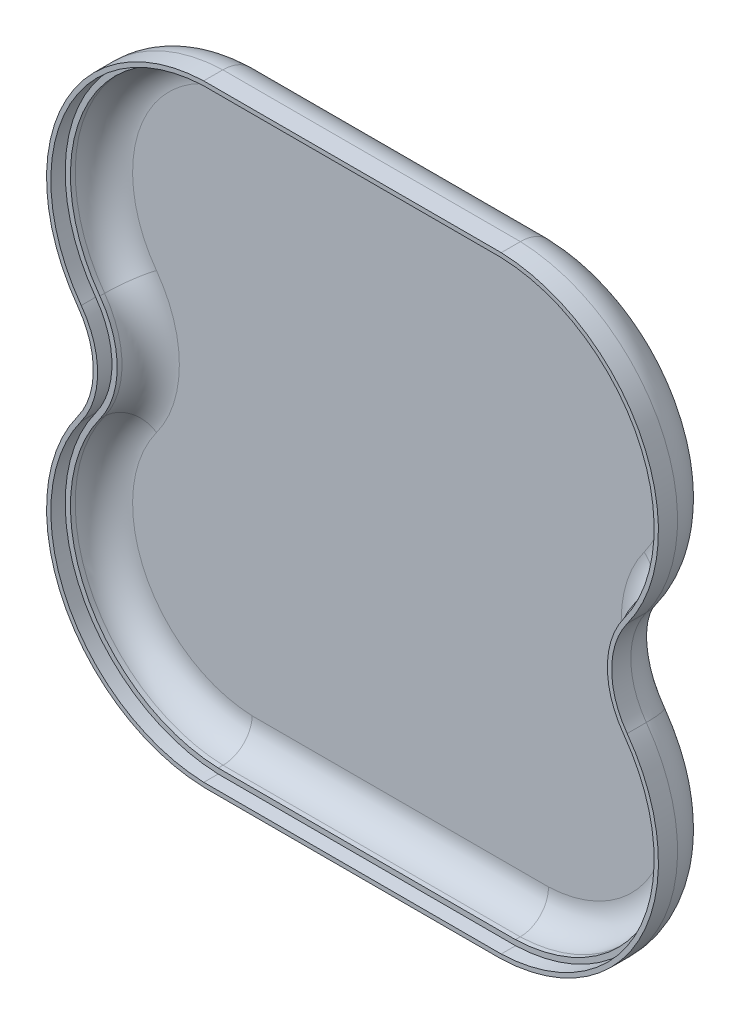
ISO-10303-21;
HEADER;
FILE_DESCRIPTION(('STEP AP214'),'2;1');
FILE_NAME('part.step','',(''),(''),'','','');
FILE_SCHEMA(('AUTOMOTIVE_DESIGN { 1 0 10303 214 1 1 1 1 }'));
ENDSEC;
DATA;
#1=APPLICATION_CONTEXT('core data for automotive mechanical design processes');
#2=APPLICATION_PROTOCOL_DEFINITION('international standard','automotive_design',2000,#1);
#3=PRODUCT_CONTEXT('',#1,'mechanical');
#4=PRODUCT('Part','Part','',(#3));
#5=PRODUCT_RELATED_PRODUCT_CATEGORY('part','',(#4));
#6=PRODUCT_DEFINITION_FORMATION('','',#4);
#7=PRODUCT_DEFINITION_CONTEXT('part definition',#1,'design');
#8=PRODUCT_DEFINITION('design','',#6,#7);
#9=PRODUCT_DEFINITION_SHAPE('','',#8);
#10=(LENGTH_UNIT() NAMED_UNIT(*) SI_UNIT(.MILLI.,.METRE.));
#11=(NAMED_UNIT(*) PLANE_ANGLE_UNIT() SI_UNIT($,.RADIAN.));
#12=(NAMED_UNIT(*) SI_UNIT($,.STERADIAN.) SOLID_ANGLE_UNIT());
#13=UNCERTAINTY_MEASURE_WITH_UNIT(LENGTH_MEASURE(1.E-05),#10,'distance_accuracy_value','');
#14=(GEOMETRIC_REPRESENTATION_CONTEXT(3) GLOBAL_UNCERTAINTY_ASSIGNED_CONTEXT((#13)) GLOBAL_UNIT_ASSIGNED_CONTEXT((#10,
#11,#12)) REPRESENTATION_CONTEXT('',''));
#15=CARTESIAN_POINT('',(0.,0.,0.));
#16=DIRECTION('',(0.,0.,1.));
#17=DIRECTION('',(1.,0.,0.));
#18=AXIS2_PLACEMENT_3D('',#15,#16,#17);
#19=CARTESIAN_POINT('',(30.,30.,0.));
#20=DIRECTION('',(0.,0.,1.));
#21=DIRECTION('',(1.,0.,0.));
#22=AXIS2_PLACEMENT_3D('',#19,#20,#21);
#23=PLANE('',#22);
#24=CARTESIAN_POINT('',(71.1060549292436,0.,0.));
#25=DIRECTION('',(0.,0.,-1.));
#26=DIRECTION('',(1.,0.,0.));
#27=AXIS2_PLACEMENT_3D('',#24,#25,#26);
#28=CIRCLE('',#27,17.7891712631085);
#29=CARTESIAN_POINT('',(56.7367375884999,-10.4870078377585,0.));
#30=VERTEX_POINT('',#29);
#31=CARTESIAN_POINT('',(56.7367375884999,10.4870078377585,0.));
#32=VERTEX_POINT('',#31);
#33=EDGE_CURVE('E363',#30,#32,#28,.T.);
#34=ORIENTED_EDGE('',*,*,#33,.T.);
#35=CARTESIAN_POINT('',(30.,30.,0.));
#36=DIRECTION('',(0.,0.,1.));
#37=DIRECTION('',(1.,0.,0.));
#38=AXIS2_PLACEMENT_3D('',#35,#36,#37);
#39=CIRCLE('',#38,33.1);
#40=CARTESIAN_POINT('',(31.1062740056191,63.0815077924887,0.));
#41=VERTEX_POINT('',#40);
#42=EDGE_CURVE('E367',#32,#41,#39,.T.);
#43=ORIENTED_EDGE('',*,*,#42,.T.);
#44=DIRECTION('',(-1.,0.,0.));
#45=VECTOR('',#44,1.);
#46=CARTESIAN_POINT('',(31.1062740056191,63.0815077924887,0.));
#47=LINE('',#46,#45);
#48=CARTESIAN_POINT('',(-31.1062740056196,63.0815077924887,0.));
#49=VERTEX_POINT('',#48);
#50=EDGE_CURVE('E975',#41,#49,#47,.T.);
#51=ORIENTED_EDGE('',*,*,#50,.T.);
#52=CARTESIAN_POINT('',(-30.,30.,0.));
#53=DIRECTION('',(0.,0.,1.));
#54=DIRECTION('',(1.,0.,0.));
#55=AXIS2_PLACEMENT_3D('',#52,#53,#54);
#56=CIRCLE('',#55,33.1);
#57=CARTESIAN_POINT('',(-56.7367375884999,10.4870078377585,0.));
#58=VERTEX_POINT('',#57);
#59=EDGE_CURVE('E977',#49,#58,#56,.T.);
#60=ORIENTED_EDGE('',*,*,#59,.T.);
#61=CARTESIAN_POINT('',(-71.1060549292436,0.,0.));
#62=DIRECTION('',(0.,0.,-1.));
#63=DIRECTION('',(1.,0.,0.));
#64=AXIS2_PLACEMENT_3D('',#61,#62,#63);
#65=CIRCLE('',#64,17.7891712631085);
#66=CARTESIAN_POINT('',(-56.7367375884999,-10.4870078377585,0.));
#67=VERTEX_POINT('',#66);
#68=EDGE_CURVE('E979',#58,#67,#65,.T.);
#69=ORIENTED_EDGE('',*,*,#68,.T.);
#70=CARTESIAN_POINT('',(-30.,-30.,0.));
#71=DIRECTION('',(0.,0.,1.));
#72=DIRECTION('',(1.,0.,0.));
#73=AXIS2_PLACEMENT_3D('',#70,#71,#72);
#74=CIRCLE('',#73,33.1);
#75=CARTESIAN_POINT('',(-31.1062740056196,-63.0815077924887,0.));
#76=VERTEX_POINT('',#75);
#77=EDGE_CURVE('E558',#67,#76,#74,.T.);
#78=ORIENTED_EDGE('',*,*,#77,.T.);
#79=DIRECTION('',(1.,0.,0.));
#80=VECTOR('',#79,1.);
#81=CARTESIAN_POINT('',(-31.1062740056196,-63.0815077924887,0.));
#82=LINE('',#81,#80);
#83=CARTESIAN_POINT('',(31.1062740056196,-63.0815077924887,0.));
#84=VERTEX_POINT('',#83);
#85=EDGE_CURVE('E552',#76,#84,#82,.T.);
#86=ORIENTED_EDGE('',*,*,#85,.T.);
#87=CARTESIAN_POINT('',(30.,-30.,0.));
#88=DIRECTION('',(0.,0.,1.));
#89=DIRECTION('',(1.,0.,0.));
#90=AXIS2_PLACEMENT_3D('',#87,#88,#89);
#91=CIRCLE('',#90,33.1);
#92=EDGE_CURVE('E556',#84,#30,#91,.T.);
#93=ORIENTED_EDGE('',*,*,#92,.T.);
#94=EDGE_LOOP('',(#34,#43,#51,#60,#69,#78,#86,#93));
#95=FACE_BOUND('',#94,.T.);
#96=CARTESIAN_POINT('',(30.,30.,0.));
#97=DIRECTION('',(0.,0.,1.));
#98=DIRECTION('',(1.,0.,0.));
#99=AXIS2_PLACEMENT_3D('',#96,#97,#98);
#100=CIRCLE('',#99,32.);
#101=CARTESIAN_POINT('',(55.8482055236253,11.1354758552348,0.));
#102=VERTEX_POINT('',#101);
#103=CARTESIAN_POINT('',(31.0877312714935,61.9815077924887,0.));
#104=VERTEX_POINT('',#103);
#105=EDGE_CURVE('E711',#102,#104,#100,.T.);
#106=ORIENTED_EDGE('',*,*,#105,.F.);
#107=CARTESIAN_POINT('',(71.1060549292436,0.,0.));
#108=DIRECTION('',(0.,0.,1.));
#109=DIRECTION('',(1.,0.,0.));
#110=AXIS2_PLACEMENT_3D('',#107,#108,#109);
#111=CIRCLE('',#110,18.8891712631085);
#112=CARTESIAN_POINT('',(55.8482055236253,-11.1354758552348,0.));
#113=VERTEX_POINT('',#112);
#114=EDGE_CURVE('E646',#113,#102,#111,.F.);
#115=ORIENTED_EDGE('',*,*,#114,.F.);
#116=CARTESIAN_POINT('',(30.,-30.,0.));
#117=DIRECTION('',(0.,0.,1.));
#118=DIRECTION('',(1.,0.,0.));
#119=AXIS2_PLACEMENT_3D('',#116,#117,#118);
#120=CIRCLE('',#119,32.);
#121=CARTESIAN_POINT('',(31.0877312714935,-61.9815077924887,0.));
#122=VERTEX_POINT('',#121);
#123=EDGE_CURVE('E1289',#122,#113,#120,.T.);
#124=ORIENTED_EDGE('',*,*,#123,.F.);
#125=DIRECTION('',(1.,0.,0.));
#126=VECTOR('',#125,1.);
#127=CARTESIAN_POINT('',(30.,-61.9815077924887,0.));
#128=LINE('',#127,#126);
#129=CARTESIAN_POINT('',(-31.0877312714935,-61.9815077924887,0.));
#130=VERTEX_POINT('',#129);
#131=EDGE_CURVE('E1300',#130,#122,#128,.T.);
#132=ORIENTED_EDGE('',*,*,#131,.F.);
#133=CARTESIAN_POINT('',(-30.,-30.,0.));
#134=DIRECTION('',(0.,0.,1.));
#135=DIRECTION('',(1.,0.,0.));
#136=AXIS2_PLACEMENT_3D('',#133,#134,#135);
#137=CIRCLE('',#136,32.);
#138=CARTESIAN_POINT('',(-55.8482055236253,-11.1354758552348,0.));
#139=VERTEX_POINT('',#138);
#140=EDGE_CURVE('E1297',#139,#130,#137,.T.);
#141=ORIENTED_EDGE('',*,*,#140,.F.);
#142=CARTESIAN_POINT('',(-71.1060549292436,0.,0.));
#143=DIRECTION('',(0.,0.,1.));
#144=DIRECTION('',(1.,0.,0.));
#145=AXIS2_PLACEMENT_3D('',#142,#143,#144);
#146=CIRCLE('',#145,18.8891712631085);
#147=CARTESIAN_POINT('',(-55.8482055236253,11.1354758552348,0.));
#148=VERTEX_POINT('',#147);
#149=EDGE_CURVE('E1292',#148,#139,#146,.F.);
#150=ORIENTED_EDGE('',*,*,#149,.F.);
#151=CARTESIAN_POINT('',(-30.,30.,0.));
#152=DIRECTION('',(0.,0.,1.));
#153=DIRECTION('',(1.,0.,0.));
#154=AXIS2_PLACEMENT_3D('',#151,#152,#153);
#155=CIRCLE('',#154,32.);
#156=CARTESIAN_POINT('',(-31.0877312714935,61.9815077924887,0.));
#157=VERTEX_POINT('',#156);
#158=EDGE_CURVE('E1239',#157,#148,#155,.T.);
#159=ORIENTED_EDGE('',*,*,#158,.F.);
#160=DIRECTION('',(-1.,0.,0.));
#161=VECTOR('',#160,1.);
#162=CARTESIAN_POINT('',(30.,61.9815077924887,0.));
#163=LINE('',#162,#161);
#164=EDGE_CURVE('E1234',#104,#157,#163,.T.);
#165=ORIENTED_EDGE('',*,*,#164,.F.);
#166=EDGE_LOOP('',(#106,#115,#124,#132,#141,#150,#159,#165));
#167=FACE_BOUND('',#166,.T.);
#168=ADVANCED_FACE('F348',(#95,#167),#23,.T.);
#169=CARTESIAN_POINT('',(30.,30.,-9.));
#170=DIRECTION('',(0.,0.,1.));
#171=DIRECTION('',(1.,0.,0.));
#172=AXIS2_PLACEMENT_3D('',#169,#170,#171);
#173=CYLINDRICAL_SURFACE('',#172,32.);
#174=DIRECTION('',(0.,0.,1.));
#175=VECTOR('',#174,1.);
#176=CARTESIAN_POINT('',(55.8482055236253,11.1354758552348,-9.));
#177=LINE('',#176,#175);
#178=CARTESIAN_POINT('',(55.8482055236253,11.1354758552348,-0.999999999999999));
#179=VERTEX_POINT('',#178);
#180=EDGE_CURVE('E635',#179,#102,#177,.T.);
#181=ORIENTED_EDGE('',*,*,#180,.T.);
#182=ORIENTED_EDGE('',*,*,#105,.T.);
#183=DIRECTION('',(0.,0.,1.));
#184=VECTOR('',#183,1.);
#185=CARTESIAN_POINT('',(31.0877312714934,61.9815077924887,-9.));
#186=LINE('',#185,#184);
#187=CARTESIAN_POINT('',(31.0877312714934,61.9815077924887,-1.00000000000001));
#188=VERTEX_POINT('',#187);
#189=EDGE_CURVE('E643',#188,#104,#186,.T.);
#190=ORIENTED_EDGE('',*,*,#189,.F.);
#191=CARTESIAN_POINT('',(30.,30.,-0.999999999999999));
#192=DIRECTION('',(0.,0.,1.));
#193=DIRECTION('',(1.,0.,0.));
#194=AXIS2_PLACEMENT_3D('',#191,#192,#193);
#195=CIRCLE('',#194,32.);
#196=EDGE_CURVE('E639',#179,#188,#195,.T.);
#197=ORIENTED_EDGE('',*,*,#196,.F.);
#198=EDGE_LOOP('',(#181,#182,#190,#197));
#199=FACE_BOUND('',#198,.T.);
#200=ADVANCED_FACE('F720',(#199),#173,.F.);
#201=CARTESIAN_POINT('',(71.1060549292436,0.,-9.));
#202=DIRECTION('',(0.,0.,1.));
#203=DIRECTION('',(1.,0.,0.));
#204=AXIS2_PLACEMENT_3D('',#201,#202,#203);
#205=CYLINDRICAL_SURFACE('',#204,18.8891712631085);
#206=DIRECTION('',(0.,0.,1.));
#207=VECTOR('',#206,1.);
#208=CARTESIAN_POINT('',(55.8482055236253,-11.1354758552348,-9.));
#209=LINE('',#208,#207);
#210=CARTESIAN_POINT('',(55.8482055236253,-11.1354758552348,-0.999999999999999));
#211=VERTEX_POINT('',#210);
#212=EDGE_CURVE('E638',#211,#113,#209,.T.);
#213=ORIENTED_EDGE('',*,*,#212,.T.);
#214=ORIENTED_EDGE('',*,*,#114,.T.);
#215=ORIENTED_EDGE('',*,*,#180,.F.);
#216=CARTESIAN_POINT('',(71.1060549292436,0.,-0.999999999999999));
#217=DIRECTION('',(0.,0.,1.));
#218=DIRECTION('',(1.,0.,0.));
#219=AXIS2_PLACEMENT_3D('',#216,#217,#218);
#220=CIRCLE('',#219,18.8891712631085);
#221=EDGE_CURVE('E642',#211,#179,#220,.F.);
#222=ORIENTED_EDGE('',*,*,#221,.F.);
#223=EDGE_LOOP('',(#213,#214,#215,#222));
#224=FACE_BOUND('',#223,.T.);
#225=ADVANCED_FACE('F723',(#224),#205,.T.);
#226=CARTESIAN_POINT('',(30.,-30.,-9.));
#227=DIRECTION('',(0.,0.,1.));
#228=DIRECTION('',(1.,0.,0.));
#229=AXIS2_PLACEMENT_3D('',#226,#227,#228);
#230=CYLINDRICAL_SURFACE('',#229,32.);
#231=DIRECTION('',(0.,0.,1.));
#232=VECTOR('',#231,1.);
#233=CARTESIAN_POINT('',(31.0877312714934,-61.9815077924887,-9.));
#234=LINE('',#233,#232);
#235=CARTESIAN_POINT('',(31.0877312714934,-61.9815077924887,-1.00000000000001));
#236=VERTEX_POINT('',#235);
#237=EDGE_CURVE('E649',#236,#122,#234,.T.);
#238=ORIENTED_EDGE('',*,*,#237,.T.);
#239=ORIENTED_EDGE('',*,*,#123,.T.);
#240=ORIENTED_EDGE('',*,*,#212,.F.);
#241=CARTESIAN_POINT('',(30.,-30.,-0.999999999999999));
#242=DIRECTION('',(0.,0.,1.));
#243=DIRECTION('',(1.,0.,0.));
#244=AXIS2_PLACEMENT_3D('',#241,#242,#243);
#245=CIRCLE('',#244,32.);
#246=EDGE_CURVE('E651',#236,#211,#245,.T.);
#247=ORIENTED_EDGE('',*,*,#246,.F.);
#248=EDGE_LOOP('',(#238,#239,#240,#247));
#249=FACE_BOUND('',#248,.T.);
#250=ADVANCED_FACE('F727',(#249),#230,.F.);
#251=CARTESIAN_POINT('',(31.1212172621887,-61.9815077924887,-9.));
#252=DIRECTION('',(0.,-1.,0.));
#253=DIRECTION('',(0.,0.,-1.));
#254=AXIS2_PLACEMENT_3D('',#251,#252,#253);
#255=PLANE('',#254);
#256=DIRECTION('',(0.,0.,1.));
#257=VECTOR('',#256,1.);
#258=CARTESIAN_POINT('',(-31.0877312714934,-61.9815077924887,-9.));
#259=LINE('',#258,#257);
#260=CARTESIAN_POINT('',(-31.0877312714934,-61.9815077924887,-0.999999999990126));
#261=VERTEX_POINT('',#260);
#262=EDGE_CURVE('E653',#261,#130,#259,.T.);
#263=ORIENTED_EDGE('',*,*,#262,.T.);
#264=ORIENTED_EDGE('',*,*,#131,.T.);
#265=ORIENTED_EDGE('',*,*,#237,.F.);
#266=DIRECTION('',(1.,0.,0.));
#267=VECTOR('',#266,1.);
#268=CARTESIAN_POINT('',(31.1212172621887,-61.9815077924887,-0.999999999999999));
#269=LINE('',#268,#267);
#270=EDGE_CURVE('E655',#261,#236,#269,.T.);
#271=ORIENTED_EDGE('',*,*,#270,.F.);
#272=EDGE_LOOP('',(#263,#264,#265,#271));
#273=FACE_BOUND('',#272,.T.);
#274=ADVANCED_FACE('F731',(#273),#255,.F.);
#275=CARTESIAN_POINT('',(-30.,-30.,-9.));
#276=DIRECTION('',(0.,0.,1.));
#277=DIRECTION('',(1.,0.,0.));
#278=AXIS2_PLACEMENT_3D('',#275,#276,#277);
#279=CYLINDRICAL_SURFACE('',#278,32.);
#280=DIRECTION('',(0.,0.,1.));
#281=VECTOR('',#280,1.);
#282=CARTESIAN_POINT('',(-55.8482055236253,-11.1354758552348,-9.));
#283=LINE('',#282,#281);
#284=CARTESIAN_POINT('',(-55.8482055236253,-11.1354758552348,-0.999999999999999));
#285=VERTEX_POINT('',#284);
#286=EDGE_CURVE('E657',#285,#139,#283,.T.);
#287=ORIENTED_EDGE('',*,*,#286,.T.);
#288=ORIENTED_EDGE('',*,*,#140,.T.);
#289=ORIENTED_EDGE('',*,*,#262,.F.);
#290=CARTESIAN_POINT('',(-30.,-30.,-0.999999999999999));
#291=DIRECTION('',(0.,0.,1.));
#292=DIRECTION('',(1.,0.,0.));
#293=AXIS2_PLACEMENT_3D('',#290,#291,#292);
#294=CIRCLE('',#293,32.);
#295=EDGE_CURVE('E659',#285,#261,#294,.T.);
#296=ORIENTED_EDGE('',*,*,#295,.F.);
#297=EDGE_LOOP('',(#287,#288,#289,#296));
#298=FACE_BOUND('',#297,.T.);
#299=ADVANCED_FACE('F735',(#298),#279,.F.);
#300=CARTESIAN_POINT('',(-71.1060549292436,0.,-9.));
#301=DIRECTION('',(0.,0.,1.));
#302=DIRECTION('',(1.,0.,0.));
#303=AXIS2_PLACEMENT_3D('',#300,#301,#302);
#304=CYLINDRICAL_SURFACE('',#303,18.8891712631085);
#305=DIRECTION('',(0.,0.,1.));
#306=VECTOR('',#305,1.);
#307=CARTESIAN_POINT('',(-55.8482055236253,11.1354758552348,-9.));
#308=LINE('',#307,#306);
#309=CARTESIAN_POINT('',(-55.8482055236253,11.1354758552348,-0.999999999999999));
#310=VERTEX_POINT('',#309);
#311=EDGE_CURVE('E661',#310,#148,#308,.T.);
#312=ORIENTED_EDGE('',*,*,#311,.T.);
#313=ORIENTED_EDGE('',*,*,#149,.T.);
#314=ORIENTED_EDGE('',*,*,#286,.F.);
#315=CARTESIAN_POINT('',(-71.1060549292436,0.,-0.999999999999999));
#316=DIRECTION('',(0.,0.,1.));
#317=DIRECTION('',(1.,0.,0.));
#318=AXIS2_PLACEMENT_3D('',#315,#316,#317);
#319=CIRCLE('',#318,18.8891712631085);
#320=EDGE_CURVE('E663',#310,#285,#319,.F.);
#321=ORIENTED_EDGE('',*,*,#320,.F.);
#322=EDGE_LOOP('',(#312,#313,#314,#321));
#323=FACE_BOUND('',#322,.T.);
#324=ADVANCED_FACE('F739',(#323),#304,.T.);
#325=CARTESIAN_POINT('',(-30.,30.,-9.));
#326=DIRECTION('',(0.,0.,1.));
#327=DIRECTION('',(1.,0.,0.));
#328=AXIS2_PLACEMENT_3D('',#325,#326,#327);
#329=CYLINDRICAL_SURFACE('',#328,32.);
#330=DIRECTION('',(0.,0.,1.));
#331=VECTOR('',#330,1.);
#332=CARTESIAN_POINT('',(-31.0877312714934,61.9815077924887,-9.));
#333=LINE('',#332,#331);
#334=CARTESIAN_POINT('',(-31.0877312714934,61.9815077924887,-0.999999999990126));
#335=VERTEX_POINT('',#334);
#336=EDGE_CURVE('E645',#335,#157,#333,.T.);
#337=ORIENTED_EDGE('',*,*,#336,.T.);
#338=ORIENTED_EDGE('',*,*,#158,.T.);
#339=ORIENTED_EDGE('',*,*,#311,.F.);
#340=CARTESIAN_POINT('',(-30.,30.,-0.999999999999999));
#341=DIRECTION('',(0.,0.,1.));
#342=DIRECTION('',(1.,0.,0.));
#343=AXIS2_PLACEMENT_3D('',#340,#341,#342);
#344=CIRCLE('',#343,32.);
#345=EDGE_CURVE('E666',#335,#310,#344,.T.);
#346=ORIENTED_EDGE('',*,*,#345,.F.);
#347=EDGE_LOOP('',(#337,#338,#339,#346));
#348=FACE_BOUND('',#347,.T.);
#349=ADVANCED_FACE('F743',(#348),#329,.F.);
#350=CARTESIAN_POINT('',(31.1212172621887,61.9815077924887,-9.));
#351=DIRECTION('',(0.,1.,0.));
#352=DIRECTION('',(0.,0.,1.));
#353=AXIS2_PLACEMENT_3D('',#350,#351,#352);
#354=PLANE('',#353);
#355=ORIENTED_EDGE('',*,*,#189,.T.);
#356=ORIENTED_EDGE('',*,*,#164,.T.);
#357=ORIENTED_EDGE('',*,*,#336,.F.);
#358=DIRECTION('',(1.,0.,0.));
#359=VECTOR('',#358,1.);
#360=CARTESIAN_POINT('',(31.1212172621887,61.9815077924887,-0.999999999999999));
#361=LINE('',#360,#359);
#362=EDGE_CURVE('E637',#188,#335,#361,.F.);
#363=ORIENTED_EDGE('',*,*,#362,.F.);
#364=EDGE_LOOP('',(#355,#356,#357,#363));
#365=FACE_BOUND('',#364,.T.);
#366=ADVANCED_FACE('F747',(#365),#354,.F.);
#367=CARTESIAN_POINT('',(30.,30.,-7.));
#368=DIRECTION('',(0.,0.,1.));
#369=DIRECTION('',(1.,0.,0.));
#370=AXIS2_PLACEMENT_3D('',#367,#368,#369);
#371=PLANE('',#370);
#372=CARTESIAN_POINT('',(-30.,30.,-7.));
#373=DIRECTION('',(0.,0.,1.));
#374=DIRECTION('',(1.,0.,0.));
#375=AXIS2_PLACEMENT_3D('',#372,#373,#374);
#376=CIRCLE('',#375,26.);
#377=CARTESIAN_POINT('',(-51.0016669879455,14.6725741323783,-7.));
#378=VERTEX_POINT('',#377);
#379=CARTESIAN_POINT('',(-30.9804350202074,55.9815077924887,-7.));
#380=VERTEX_POINT('',#379);
#381=EDGE_CURVE('E687',#378,#380,#376,.F.);
#382=ORIENTED_EDGE('',*,*,#381,.F.);
#383=CARTESIAN_POINT('',(-71.1060549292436,0.,-7.));
#384=DIRECTION('',(0.,0.,1.));
#385=DIRECTION('',(1.,0.,0.));
#386=AXIS2_PLACEMENT_3D('',#383,#384,#385);
#387=CIRCLE('',#386,24.8891712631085);
#388=CARTESIAN_POINT('',(-51.0016669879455,-14.6725741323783,-7.));
#389=VERTEX_POINT('',#388);
#390=EDGE_CURVE('E1246',#389,#378,#387,.T.);
#391=ORIENTED_EDGE('',*,*,#390,.F.);
#392=CARTESIAN_POINT('',(-30.,-30.,-7.));
#393=DIRECTION('',(0.,0.,1.));
#394=DIRECTION('',(1.,0.,0.));
#395=AXIS2_PLACEMENT_3D('',#392,#393,#394);
#396=CIRCLE('',#395,26.);
#397=CARTESIAN_POINT('',(-30.9804350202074,-55.9815077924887,-7.));
#398=VERTEX_POINT('',#397);
#399=EDGE_CURVE('E1253',#398,#389,#396,.F.);
#400=ORIENTED_EDGE('',*,*,#399,.F.);
#401=DIRECTION('',(1.,0.,0.));
#402=VECTOR('',#401,1.);
#403=CARTESIAN_POINT('',(30.,-55.9815077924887,-7.));
#404=LINE('',#403,#402);
#405=CARTESIAN_POINT('',(30.9804350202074,-55.9815077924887,-7.));
#406=VERTEX_POINT('',#405);
#407=EDGE_CURVE('E1251',#406,#398,#404,.F.);
#408=ORIENTED_EDGE('',*,*,#407,.F.);
#409=CARTESIAN_POINT('',(30.,-30.,-7.));
#410=DIRECTION('',(0.,0.,1.));
#411=DIRECTION('',(1.,0.,0.));
#412=AXIS2_PLACEMENT_3D('',#409,#410,#411);
#413=CIRCLE('',#412,26.);
#414=CARTESIAN_POINT('',(51.0016669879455,-14.6725741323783,-7.));
#415=VERTEX_POINT('',#414);
#416=EDGE_CURVE('E1249',#415,#406,#413,.F.);
#417=ORIENTED_EDGE('',*,*,#416,.F.);
#418=CARTESIAN_POINT('',(71.1060549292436,0.,-7.));
#419=DIRECTION('',(0.,0.,1.));
#420=DIRECTION('',(1.,0.,0.));
#421=AXIS2_PLACEMENT_3D('',#418,#419,#420);
#422=CIRCLE('',#421,24.8891712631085);
#423=CARTESIAN_POINT('',(51.0016669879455,14.6725741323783,-7.));
#424=VERTEX_POINT('',#423);
#425=EDGE_CURVE('E679',#424,#415,#422,.T.);
#426=ORIENTED_EDGE('',*,*,#425,.F.);
#427=CARTESIAN_POINT('',(30.,30.,-7.));
#428=DIRECTION('',(0.,0.,1.));
#429=DIRECTION('',(1.,0.,0.));
#430=AXIS2_PLACEMENT_3D('',#427,#428,#429);
#431=CIRCLE('',#430,26.);
#432=CARTESIAN_POINT('',(30.9804350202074,55.9815077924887,-7.));
#433=VERTEX_POINT('',#432);
#434=EDGE_CURVE('E672',#433,#424,#431,.F.);
#435=ORIENTED_EDGE('',*,*,#434,.F.);
#436=DIRECTION('',(1.,0.,0.));
#437=VECTOR('',#436,1.);
#438=CARTESIAN_POINT('',(30.,55.9815077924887,-7.));
#439=LINE('',#438,#437);
#440=EDGE_CURVE('E669',#380,#433,#439,.T.);
#441=ORIENTED_EDGE('',*,*,#440,.F.);
#442=EDGE_LOOP('',(#382,#391,#400,#408,#417,#426,#435,#441));
#443=FACE_BOUND('',#442,.T.);
#444=ADVANCED_FACE('F751',(#443),#371,.T.);
#445=CARTESIAN_POINT('',(31.1212172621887,-55.9815077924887,-0.999999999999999));
#446=DIRECTION('',(-1.,0.,0.));
#447=DIRECTION('',(0.,0.,1.));
#448=AXIS2_PLACEMENT_3D('',#445,#446,#447);
#449=CYLINDRICAL_SURFACE('',#448,6.);
#450=CARTESIAN_POINT('',(-30.9804350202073,-55.9815077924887,-7.));
#451=CARTESIAN_POINT('',(-30.9809364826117,-56.0080946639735,-7.00000024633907));
#452=CARTESIAN_POINT('',(-30.9814375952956,-56.0346834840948,-6.99982346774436));
#453=CARTESIAN_POINT('',(-30.9851087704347,-56.2296237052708,-6.99723033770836));
#454=CARTESIAN_POINT('',(-30.9882632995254,-56.3979468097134,-6.98789848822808));
#455=CARTESIAN_POINT('',(-30.9945183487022,-56.7332871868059,-6.95510221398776));
#456=CARTESIAN_POINT('',(-30.9976188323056,-56.9003035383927,-6.93162859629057));
#457=CARTESIAN_POINT('',(-31.0037514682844,-57.2321632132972,-6.87063736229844));
#458=CARTESIAN_POINT('',(-31.0067834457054,-57.3970006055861,-6.83308733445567));
#459=CARTESIAN_POINT('',(-31.0127535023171,-57.7229956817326,-6.74419528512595));
#460=CARTESIAN_POINT('',(-31.0156915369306,-57.8841516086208,-6.69284682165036));
#461=CARTESIAN_POINT('',(-31.0214524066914,-58.201467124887,-6.5767646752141));
#462=CARTESIAN_POINT('',(-31.0242753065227,-58.3576295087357,-6.5120386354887));
#463=CARTESIAN_POINT('',(-31.0297893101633,-58.6638699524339,-6.36967726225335));
#464=CARTESIAN_POINT('',(-31.0324804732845,-58.8139507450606,-6.29204780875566));
#465=CARTESIAN_POINT('',(-31.0377129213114,-59.1068361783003,-6.12452363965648));
#466=CARTESIAN_POINT('',(-31.0402544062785,-59.2496504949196,-6.03464585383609));
#467=CARTESIAN_POINT('',(-31.0451759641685,-59.5271610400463,-5.84321751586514));
#468=CARTESIAN_POINT('',(-31.0475560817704,-59.6618595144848,-5.74167021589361));
#469=CARTESIAN_POINT('',(-31.0526799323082,-59.9527535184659,-5.50249598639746));
#470=CARTESIAN_POINT('',(-31.0553782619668,-60.106594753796,-5.3619892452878));
#471=CARTESIAN_POINT('',(-31.0604866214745,-60.3988418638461,-5.06576507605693));
#472=CARTESIAN_POINT('',(-31.0628966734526,-60.5372489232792,-4.91004881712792));
#473=CARTESIAN_POINT('',(-31.0669797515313,-60.7724345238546,-4.61599631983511));
#474=CARTESIAN_POINT('',(-31.0687058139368,-60.8721262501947,-4.47997823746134));
#475=CARTESIAN_POINT('',(-31.0719473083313,-61.0597434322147,-4.19998792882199));
#476=CARTESIAN_POINT('',(-31.0734626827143,-61.147665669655,-4.05601354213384));
#477=CARTESIAN_POINT('',(-31.0762762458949,-61.3112053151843,-3.76094610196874));
#478=CARTESIAN_POINT('',(-31.0775740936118,-61.3868033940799,-3.60984233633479));
#479=CARTESIAN_POINT('',(-31.0799429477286,-61.5249924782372,-3.30179794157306));
#480=CARTESIAN_POINT('',(-31.0810139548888,-61.5875835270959,-3.14485733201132));
#481=CARTESIAN_POINT('',(-31.082922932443,-61.6992766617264,-2.82635701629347));
#482=CARTESIAN_POINT('',(-31.0837610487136,-61.7483871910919,-2.66480027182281));
#483=CARTESIAN_POINT('',(-31.0852008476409,-61.8328247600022,-2.33811717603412));
#484=CARTESIAN_POINT('',(-31.0858025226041,-61.8681513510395,-2.17299070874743));
#485=CARTESIAN_POINT('',(-31.0867659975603,-61.9247478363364,-1.84042777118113));
#486=CARTESIAN_POINT('',(-31.0871279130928,-61.946024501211,-1.67299245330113));
#487=CARTESIAN_POINT('',(-31.0876107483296,-61.9744186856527,-1.33692098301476));
#488=CARTESIAN_POINT('',(-31.0877316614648,-61.9815358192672,-1.16828479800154));
#489=CARTESIAN_POINT('',(-31.0877312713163,-61.9815077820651,-0.99964632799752));
#490=B_SPLINE_CURVE_WITH_KNOTS('',3,(#450,#451,#452,#453,#454,#455,#456,#457,#458,#459,#460,
#461,#462,#463,#464,#465,#466,#467,#468,#469,#470,#471,#472,#473,#474,#475,#476,#477,#478,#479,
#480,#481,#482,#483,#484,#485,#486,#487,#488,#489),.UNSPECIFIED.,.F.,.F.,(4,2,2,2,2,2,2,2,2,2,2,
2,2,2,2,2,2,2,2,4),(0.,0.0797797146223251,0.584933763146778,1.09041654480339,1.59707044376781,
2.10396129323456,2.6105633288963,3.11693513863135,3.62261400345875,4.12815228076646,
4.75209663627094,5.37599306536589,5.88136405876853,6.3868729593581,6.89316722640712,
7.39945979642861,7.90543452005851,8.411425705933,8.9171728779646,9.42293383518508),.UNSPECIFIED.);
#491=EDGE_CURVE('E1256',#398,#261,#490,.T.);
#492=ORIENTED_EDGE('',*,*,#491,.T.);
#493=ORIENTED_EDGE('',*,*,#270,.T.);
#494=CARTESIAN_POINT('',(30.9804350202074,-55.9815077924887,-7.));
#495=CARTESIAN_POINT('',(30.9809364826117,-56.0080946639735,-7.00000024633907));
#496=CARTESIAN_POINT('',(30.9814375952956,-56.0346834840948,-6.99982346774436));
#497=CARTESIAN_POINT('',(30.9851087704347,-56.2296237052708,-6.99723033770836));
#498=CARTESIAN_POINT('',(30.9882632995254,-56.3979468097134,-6.98789848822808));
#499=CARTESIAN_POINT('',(30.9945183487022,-56.7332871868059,-6.95510221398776));
#500=CARTESIAN_POINT('',(30.9976188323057,-56.9003035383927,-6.93162859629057));
#501=CARTESIAN_POINT('',(31.0037514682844,-57.2321632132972,-6.87063736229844));
#502=CARTESIAN_POINT('',(31.0067834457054,-57.3970006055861,-6.83308733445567));
#503=CARTESIAN_POINT('',(31.0127535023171,-57.7229956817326,-6.74419528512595));
#504=CARTESIAN_POINT('',(31.0156915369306,-57.8841516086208,-6.69284682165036));
#505=CARTESIAN_POINT('',(31.0214524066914,-58.201467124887,-6.5767646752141));
#506=CARTESIAN_POINT('',(31.0242753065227,-58.3576295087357,-6.5120386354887));
#507=CARTESIAN_POINT('',(31.0297893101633,-58.6638699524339,-6.36967726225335));
#508=CARTESIAN_POINT('',(31.0324804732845,-58.8139507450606,-6.29204780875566));
#509=CARTESIAN_POINT('',(31.0377129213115,-59.1068361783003,-6.12452363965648));
#510=CARTESIAN_POINT('',(31.0402544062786,-59.2496504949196,-6.03464585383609));
#511=CARTESIAN_POINT('',(31.0451759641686,-59.5271610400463,-5.84321751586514));
#512=CARTESIAN_POINT('',(31.0475560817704,-59.6618595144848,-5.74167021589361));
#513=CARTESIAN_POINT('',(31.0526799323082,-59.9527535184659,-5.50249598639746));
#514=CARTESIAN_POINT('',(31.0553782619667,-60.106594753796,-5.3619892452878));
#515=CARTESIAN_POINT('',(31.0604866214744,-60.3988418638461,-5.06576507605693));
#516=CARTESIAN_POINT('',(31.0628966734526,-60.5372489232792,-4.91004881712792));
#517=CARTESIAN_POINT('',(31.0669797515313,-60.7724345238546,-4.61599631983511));
#518=CARTESIAN_POINT('',(31.0687058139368,-60.8721262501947,-4.47997823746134));
#519=CARTESIAN_POINT('',(31.0719473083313,-61.0597434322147,-4.19998792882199));
#520=CARTESIAN_POINT('',(31.0734626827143,-61.147665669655,-4.05601354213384));
#521=CARTESIAN_POINT('',(31.0762762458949,-61.3112053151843,-3.76094610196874));
#522=CARTESIAN_POINT('',(31.0775740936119,-61.3868033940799,-3.60984233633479));
#523=CARTESIAN_POINT('',(31.0799429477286,-61.5249924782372,-3.30179794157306));
#524=CARTESIAN_POINT('',(31.0810139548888,-61.5875835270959,-3.14485733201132));
#525=CARTESIAN_POINT('',(31.082922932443,-61.6992766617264,-2.82635701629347));
#526=CARTESIAN_POINT('',(31.0837610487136,-61.7483871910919,-2.66480027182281));
#527=CARTESIAN_POINT('',(31.0852008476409,-61.8328247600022,-2.33811717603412));
#528=CARTESIAN_POINT('',(31.0858025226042,-61.8681513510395,-2.17299070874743));
#529=CARTESIAN_POINT('',(31.0867659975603,-61.9247478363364,-1.84042777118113));
#530=CARTESIAN_POINT('',(31.0871279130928,-61.946024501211,-1.67299245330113));
#531=CARTESIAN_POINT('',(31.0876107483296,-61.9744186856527,-1.33692098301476));
#532=CARTESIAN_POINT('',(31.0877316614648,-61.9815358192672,-1.16828479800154));
#533=CARTESIAN_POINT('',(31.0877312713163,-61.9815077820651,-0.99964632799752));
#534=B_SPLINE_CURVE_WITH_KNOTS('',3,(#494,#495,#496,#497,#498,#499,#500,#501,#502,#503,#504,
#505,#506,#507,#508,#509,#510,#511,#512,#513,#514,#515,#516,#517,#518,#519,#520,#521,#522,#523,
#524,#525,#526,#527,#528,#529,#530,#531,#532,#533),.UNSPECIFIED.,.F.,.F.,(4,2,2,2,2,2,2,2,2,2,2,
2,2,2,2,2,2,2,2,4),(0.,0.0797797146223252,0.584933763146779,1.09041654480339,1.59707044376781,
2.10396129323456,2.6105633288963,3.11693513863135,3.62261400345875,4.12815228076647,
4.75209663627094,5.37599306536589,5.88136405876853,6.3868729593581,6.89316722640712,
7.39945979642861,7.90543452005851,8.411425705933,8.9171728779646,9.42293383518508),.UNSPECIFIED.);
#535=EDGE_CURVE('E1262',#236,#406,#534,.F.);
#536=ORIENTED_EDGE('',*,*,#535,.T.);
#537=ORIENTED_EDGE('',*,*,#407,.T.);
#538=EDGE_LOOP('',(#492,#493,#536,#537));
#539=FACE_BOUND('',#538,.T.);
#540=ADVANCED_FACE('F755',(#539),#449,.F.);
#541=CARTESIAN_POINT('',(30.,-30.,-0.999999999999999));
#542=DIRECTION('',(0.,0.,1.));
#543=DIRECTION('',(1.,0.,0.));
#544=AXIS2_PLACEMENT_3D('',#541,#542,#543);
#545=TOROIDAL_SURFACE('',#544,26.,6.);
#546=ORIENTED_EDGE('',*,*,#535,.F.);
#547=ORIENTED_EDGE('',*,*,#246,.T.);
#548=CARTESIAN_POINT('',(51.0016669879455,-14.6725741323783,-0.999999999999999));
#549=DIRECTION('',(-0.589516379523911,0.80775642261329,0.));
#550=DIRECTION('',(-0.80775642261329,-0.589516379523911,0.));
#551=AXIS2_PLACEMENT_3D('',#548,#549,#550);
#552=CIRCLE('',#551,6.);
#553=EDGE_CURVE('E1263',#211,#415,#552,.T.);
#554=ORIENTED_EDGE('',*,*,#553,.T.);
#555=ORIENTED_EDGE('',*,*,#416,.T.);
#556=EDGE_LOOP('',(#546,#547,#554,#555));
#557=FACE_BOUND('',#556,.T.);
#558=ADVANCED_FACE('F718',(#557),#545,.F.);
#559=CARTESIAN_POINT('',(-30.,-30.,-0.999999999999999));
#560=DIRECTION('',(0.,0.,1.));
#561=DIRECTION('',(1.,0.,0.));
#562=AXIS2_PLACEMENT_3D('',#559,#560,#561);
#563=TOROIDAL_SURFACE('',#562,26.,6.);
#564=ORIENTED_EDGE('',*,*,#491,.F.);
#565=ORIENTED_EDGE('',*,*,#399,.T.);
#566=CARTESIAN_POINT('',(-51.0016669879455,-14.6725741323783,-0.999999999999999));
#567=DIRECTION('',(-0.589516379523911,-0.80775642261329,0.));
#568=DIRECTION('',(0.80775642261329,-0.589516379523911,0.));
#569=AXIS2_PLACEMENT_3D('',#566,#567,#568);
#570=CIRCLE('',#569,6.);
#571=EDGE_CURVE('E676',#389,#285,#570,.F.);
#572=ORIENTED_EDGE('',*,*,#571,.T.);
#573=ORIENTED_EDGE('',*,*,#295,.T.);
#574=EDGE_LOOP('',(#564,#565,#572,#573));
#575=FACE_BOUND('',#574,.T.);
#576=ADVANCED_FACE('F699',(#575),#563,.F.);
#577=CARTESIAN_POINT('',(71.1060549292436,0.,-0.999999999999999));
#578=DIRECTION('',(0.,0.,1.));
#579=DIRECTION('',(1.,0.,0.));
#580=AXIS2_PLACEMENT_3D('',#577,#578,#579);
#581=TOROIDAL_SURFACE('',#580,24.8891712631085,6.);
#582=ORIENTED_EDGE('',*,*,#553,.F.);
#583=ORIENTED_EDGE('',*,*,#221,.T.);
#584=CARTESIAN_POINT('',(51.0016669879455,14.6725741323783,-0.999999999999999));
#585=DIRECTION('',(-0.589516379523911,-0.80775642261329,0.));
#586=DIRECTION('',(0.80775642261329,-0.589516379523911,0.));
#587=AXIS2_PLACEMENT_3D('',#584,#585,#586);
#588=CIRCLE('',#587,6.);
#589=EDGE_CURVE('E673',#179,#424,#588,.F.);
#590=ORIENTED_EDGE('',*,*,#589,.T.);
#591=ORIENTED_EDGE('',*,*,#425,.T.);
#592=EDGE_LOOP('',(#582,#583,#590,#591));
#593=FACE_BOUND('',#592,.T.);
#594=ADVANCED_FACE('F757',(#593),#581,.F.);
#595=CARTESIAN_POINT('',(-71.1060549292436,0.,-0.999999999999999));
#596=DIRECTION('',(0.,0.,1.));
#597=DIRECTION('',(1.,0.,0.));
#598=AXIS2_PLACEMENT_3D('',#595,#596,#597);
#599=TOROIDAL_SURFACE('',#598,24.8891712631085,6.);
#600=ORIENTED_EDGE('',*,*,#571,.F.);
#601=ORIENTED_EDGE('',*,*,#390,.T.);
#602=CARTESIAN_POINT('',(-51.0016669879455,14.6725741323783,-0.999999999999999));
#603=DIRECTION('',(-0.589516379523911,0.80775642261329,0.));
#604=DIRECTION('',(-0.80775642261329,-0.589516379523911,0.));
#605=AXIS2_PLACEMENT_3D('',#602,#603,#604);
#606=CIRCLE('',#605,6.);
#607=EDGE_CURVE('E677',#378,#310,#606,.T.);
#608=ORIENTED_EDGE('',*,*,#607,.T.);
#609=ORIENTED_EDGE('',*,*,#320,.T.);
#610=EDGE_LOOP('',(#600,#601,#608,#609));
#611=FACE_BOUND('',#610,.T.);
#612=ADVANCED_FACE('F760',(#611),#599,.F.);
#613=CARTESIAN_POINT('',(30.,30.,-0.999999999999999));
#614=DIRECTION('',(0.,0.,1.));
#615=DIRECTION('',(1.,0.,0.));
#616=AXIS2_PLACEMENT_3D('',#613,#614,#615);
#617=TOROIDAL_SURFACE('',#616,26.,6.);
#618=ORIENTED_EDGE('',*,*,#589,.F.);
#619=ORIENTED_EDGE('',*,*,#196,.T.);
#620=CARTESIAN_POINT('',(30.9804350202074,55.9815077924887,-7.));
#621=CARTESIAN_POINT('',(30.9809364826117,56.0080946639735,-7.00000024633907));
#622=CARTESIAN_POINT('',(30.9814375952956,56.0346834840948,-6.99982346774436));
#623=CARTESIAN_POINT('',(30.9851087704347,56.2296237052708,-6.99723033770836));
#624=CARTESIAN_POINT('',(30.9882632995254,56.3979468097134,-6.98789848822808));
#625=CARTESIAN_POINT('',(30.9945183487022,56.7332871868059,-6.95510221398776));
#626=CARTESIAN_POINT('',(30.9976188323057,56.9003035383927,-6.93162859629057));
#627=CARTESIAN_POINT('',(31.0037514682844,57.2321632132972,-6.87063736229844));
#628=CARTESIAN_POINT('',(31.0067834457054,57.3970006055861,-6.83308733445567));
#629=CARTESIAN_POINT('',(31.0127535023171,57.7229956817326,-6.74419528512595));
#630=CARTESIAN_POINT('',(31.0156915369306,57.8841516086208,-6.69284682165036));
#631=CARTESIAN_POINT('',(31.0214524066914,58.201467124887,-6.5767646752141));
#632=CARTESIAN_POINT('',(31.0242753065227,58.3576295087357,-6.5120386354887));
#633=CARTESIAN_POINT('',(31.0297893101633,58.6638699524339,-6.36967726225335));
#634=CARTESIAN_POINT('',(31.0324804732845,58.8139507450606,-6.29204780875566));
#635=CARTESIAN_POINT('',(31.0377129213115,59.1068361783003,-6.12452363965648));
#636=CARTESIAN_POINT('',(31.0402544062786,59.2496504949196,-6.03464585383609));
#637=CARTESIAN_POINT('',(31.0451759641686,59.5271610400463,-5.84321751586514));
#638=CARTESIAN_POINT('',(31.0475560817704,59.6618595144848,-5.74167021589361));
#639=CARTESIAN_POINT('',(31.0526799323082,59.9527535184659,-5.50249598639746));
#640=CARTESIAN_POINT('',(31.0553782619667,60.106594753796,-5.3619892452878));
#641=CARTESIAN_POINT('',(31.0604866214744,60.3988418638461,-5.06576507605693));
#642=CARTESIAN_POINT('',(31.0628966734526,60.5372489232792,-4.91004881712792));
#643=CARTESIAN_POINT('',(31.0669797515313,60.7724345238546,-4.61599631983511));
#644=CARTESIAN_POINT('',(31.0687058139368,60.8721262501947,-4.47997823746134));
#645=CARTESIAN_POINT('',(31.0719473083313,61.0597434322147,-4.19998792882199));
#646=CARTESIAN_POINT('',(31.0734626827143,61.147665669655,-4.05601354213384));
#647=CARTESIAN_POINT('',(31.0762762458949,61.3112053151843,-3.76094610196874));
#648=CARTESIAN_POINT('',(31.0775740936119,61.3868033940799,-3.60984233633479));
#649=CARTESIAN_POINT('',(31.0799429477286,61.5249924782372,-3.30179794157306));
#650=CARTESIAN_POINT('',(31.0810139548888,61.5875835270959,-3.14485733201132));
#651=CARTESIAN_POINT('',(31.082922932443,61.6992766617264,-2.82635701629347));
#652=CARTESIAN_POINT('',(31.0837610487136,61.7483871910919,-2.66480027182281));
#653=CARTESIAN_POINT('',(31.0852008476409,61.8328247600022,-2.33811717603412));
#654=CARTESIAN_POINT('',(31.0858025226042,61.8681513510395,-2.17299070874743));
#655=CARTESIAN_POINT('',(31.0867659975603,61.9247478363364,-1.84042777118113));
#656=CARTESIAN_POINT('',(31.0871279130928,61.946024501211,-1.67299245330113));
#657=CARTESIAN_POINT('',(31.0876107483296,61.9744186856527,-1.33692098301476));
#658=CARTESIAN_POINT('',(31.0877316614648,61.9815358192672,-1.16828479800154));
#659=CARTESIAN_POINT('',(31.0877312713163,61.9815077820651,-0.99964632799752));
#660=B_SPLINE_CURVE_WITH_KNOTS('',3,(#620,#621,#622,#623,#624,#625,#626,#627,#628,#629,#630,
#631,#632,#633,#634,#635,#636,#637,#638,#639,#640,#641,#642,#643,#644,#645,#646,#647,#648,#649,
#650,#651,#652,#653,#654,#655,#656,#657,#658,#659),.UNSPECIFIED.,.F.,.F.,(4,2,2,2,2,2,2,2,2,2,2,
2,2,2,2,2,2,2,2,4),(0.,0.0797797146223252,0.584933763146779,1.09041654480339,1.59707044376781,
2.10396129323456,2.6105633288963,3.11693513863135,3.62261400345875,4.12815228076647,
4.75209663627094,5.37599306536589,5.88136405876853,6.3868729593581,6.89316722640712,
7.39945979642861,7.90543452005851,8.411425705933,8.9171728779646,9.42293383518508),.UNSPECIFIED.);
#661=EDGE_CURVE('E680',#188,#433,#660,.F.);
#662=ORIENTED_EDGE('',*,*,#661,.T.);
#663=ORIENTED_EDGE('',*,*,#434,.T.);
#664=EDGE_LOOP('',(#618,#619,#662,#663));
#665=FACE_BOUND('',#664,.T.);
#666=ADVANCED_FACE('F689',(#665),#617,.F.);
#667=CARTESIAN_POINT('',(-30.,30.,-0.999999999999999));
#668=DIRECTION('',(0.,0.,1.));
#669=DIRECTION('',(1.,0.,0.));
#670=AXIS2_PLACEMENT_3D('',#667,#668,#669);
#671=TOROIDAL_SURFACE('',#670,26.,6.);
#672=ORIENTED_EDGE('',*,*,#607,.F.);
#673=ORIENTED_EDGE('',*,*,#381,.T.);
#674=CARTESIAN_POINT('',(-30.9804350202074,55.9815077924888,-7.));
#675=CARTESIAN_POINT('',(-30.9809364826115,56.0080946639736,-7.00000024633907));
#676=CARTESIAN_POINT('',(-30.9814375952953,56.0346834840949,-6.99982346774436));
#677=CARTESIAN_POINT('',(-30.9851087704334,56.229623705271,-6.99723033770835));
#678=CARTESIAN_POINT('',(-30.9882632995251,56.3979468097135,-6.98789848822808));
#679=CARTESIAN_POINT('',(-30.9945183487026,56.733287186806,-6.95510221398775));
#680=CARTESIAN_POINT('',(-30.9976188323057,56.9003035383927,-6.93162859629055));
#681=CARTESIAN_POINT('',(-31.0037514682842,57.2321632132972,-6.87063736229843));
#682=CARTESIAN_POINT('',(-31.0067834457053,57.3970006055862,-6.83308733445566));
#683=CARTESIAN_POINT('',(-31.0127535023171,57.7229956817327,-6.74419528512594));
#684=CARTESIAN_POINT('',(-31.0156915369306,57.8841516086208,-6.69284682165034));
#685=CARTESIAN_POINT('',(-31.0214524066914,58.201467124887,-6.57676467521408));
#686=CARTESIAN_POINT('',(-31.0242753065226,58.3576295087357,-6.51203863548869));
#687=CARTESIAN_POINT('',(-31.0297893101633,58.663869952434,-6.36967726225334));
#688=CARTESIAN_POINT('',(-31.0324804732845,58.8139507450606,-6.29204780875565));
#689=CARTESIAN_POINT('',(-31.0377129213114,59.1068361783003,-6.12452363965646));
#690=CARTESIAN_POINT('',(-31.0402544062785,59.2496504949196,-6.03464585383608));
#691=CARTESIAN_POINT('',(-31.0451759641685,59.5271610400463,-5.84321751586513));
#692=CARTESIAN_POINT('',(-31.0475560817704,59.6618595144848,-5.74167021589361));
#693=CARTESIAN_POINT('',(-31.0526799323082,59.9527535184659,-5.50249598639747));
#694=CARTESIAN_POINT('',(-31.0553782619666,60.106594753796,-5.3619892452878));
#695=CARTESIAN_POINT('',(-31.0604866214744,60.3988418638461,-5.06576507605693));
#696=CARTESIAN_POINT('',(-31.0628966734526,60.5372489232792,-4.91004881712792));
#697=CARTESIAN_POINT('',(-31.0669797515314,60.7724345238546,-4.61599631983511));
#698=CARTESIAN_POINT('',(-31.0687058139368,60.8721262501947,-4.47997823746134));
#699=CARTESIAN_POINT('',(-31.0719473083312,61.0597434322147,-4.19998792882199));
#700=CARTESIAN_POINT('',(-31.0734626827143,61.147665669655,-4.05601354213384));
#701=CARTESIAN_POINT('',(-31.0762762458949,61.3112053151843,-3.76094610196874));
#702=CARTESIAN_POINT('',(-31.0775740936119,61.3868033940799,-3.60984233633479));
#703=CARTESIAN_POINT('',(-31.0799429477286,61.5249924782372,-3.30179794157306));
#704=CARTESIAN_POINT('',(-31.0810139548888,61.5875835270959,-3.14485733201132));
#705=CARTESIAN_POINT('',(-31.082922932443,61.6992766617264,-2.82635701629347));
#706=CARTESIAN_POINT('',(-31.0837610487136,61.7483871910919,-2.66480027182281));
#707=CARTESIAN_POINT('',(-31.0852008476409,61.8328247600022,-2.33811717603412));
#708=CARTESIAN_POINT('',(-31.0858025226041,61.8681513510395,-2.17299070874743));
#709=CARTESIAN_POINT('',(-31.0867659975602,61.9247478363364,-1.84042777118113));
#710=CARTESIAN_POINT('',(-31.0871279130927,61.946024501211,-1.67299245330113));
#711=CARTESIAN_POINT('',(-31.0876107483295,61.9744186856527,-1.33692098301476));
#712=CARTESIAN_POINT('',(-31.0877316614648,61.9815358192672,-1.16828479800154));
#713=CARTESIAN_POINT('',(-31.0877312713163,61.9815077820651,-0.99964632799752));
#714=B_SPLINE_CURVE_WITH_KNOTS('',3,(#674,#675,#676,#677,#678,#679,#680,#681,#682,#683,#684,
#685,#686,#687,#688,#689,#690,#691,#692,#693,#694,#695,#696,#697,#698,#699,#700,#701,#702,#703,
#704,#705,#706,#707,#708,#709,#710,#711,#712,#713),.UNSPECIFIED.,.F.,.F.,(4,2,2,2,2,2,2,2,2,2,2,
2,2,2,2,2,2,2,2,4),(0.,0.0797797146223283,0.584933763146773,1.09041654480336,1.59707044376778,
2.10396129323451,2.61056332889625,3.11693513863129,3.62261400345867,4.12815228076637,
4.75209663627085,5.37599306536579,5.88136405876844,6.38687295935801,6.89316722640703,
7.39945979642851,7.90543452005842,8.41142570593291,8.91717287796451,9.42293383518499),.UNSPECIFIED.);
#715=EDGE_CURVE('E634',#380,#335,#714,.T.);
#716=ORIENTED_EDGE('',*,*,#715,.T.);
#717=ORIENTED_EDGE('',*,*,#345,.T.);
#718=EDGE_LOOP('',(#672,#673,#716,#717));
#719=FACE_BOUND('',#718,.T.);
#720=ADVANCED_FACE('F697',(#719),#671,.F.);
#721=CARTESIAN_POINT('',(31.1212172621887,55.9815077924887,-0.999999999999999));
#722=DIRECTION('',(1.,0.,0.));
#723=DIRECTION('',(0.,0.,-1.));
#724=AXIS2_PLACEMENT_3D('',#721,#722,#723);
#725=CYLINDRICAL_SURFACE('',#724,6.);
#726=ORIENTED_EDGE('',*,*,#661,.F.);
#727=ORIENTED_EDGE('',*,*,#362,.T.);
#728=ORIENTED_EDGE('',*,*,#715,.F.);
#729=ORIENTED_EDGE('',*,*,#440,.T.);
#730=EDGE_LOOP('',(#726,#727,#728,#729));
#731=FACE_BOUND('',#730,.T.);
#732=ADVANCED_FACE('F692',(#731),#725,.F.);
#733=CARTESIAN_POINT('',(-30.,-30.,3.));
#734=DIRECTION('',(0.,0.,1.));
#735=DIRECTION('',(1.,0.,0.));
#736=AXIS2_PLACEMENT_3D('',#733,#734,#735);
#737=PLANE('',#736);
#738=CARTESIAN_POINT('',(-30.,-30.,3.));
#739=DIRECTION('',(0.,0.,1.));
#740=DIRECTION('',(1.,0.,0.));
#741=AXIS2_PLACEMENT_3D('',#738,#739,#740);
#742=CIRCLE('',#741,34.);
#743=CARTESIAN_POINT('',(-57.4637183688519,-9.95644309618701,3.));
#744=VERTEX_POINT('',#743);
#745=CARTESIAN_POINT('',(-31.1212172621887,-63.9815077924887,3.));
#746=VERTEX_POINT('',#745);
#747=EDGE_CURVE('E610',#744,#746,#742,.T.);
#748=ORIENTED_EDGE('',*,*,#747,.T.);
#749=DIRECTION('',(1.,0.,0.));
#750=VECTOR('',#749,1.);
#751=CARTESIAN_POINT('',(-31.1212172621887,-63.9815077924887,3.));
#752=LINE('',#751,#750);
#753=CARTESIAN_POINT('',(31.1212172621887,-63.9815077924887,3.));
#754=VERTEX_POINT('',#753);
#755=EDGE_CURVE('E613',#746,#754,#752,.T.);
#756=ORIENTED_EDGE('',*,*,#755,.T.);
#757=CARTESIAN_POINT('',(30.,-30.,3.));
#758=DIRECTION('',(0.,0.,1.));
#759=DIRECTION('',(1.,0.,0.));
#760=AXIS2_PLACEMENT_3D('',#757,#758,#759);
#761=CIRCLE('',#760,34.);
#762=CARTESIAN_POINT('',(57.4637183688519,-9.95644309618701,3.));
#763=VERTEX_POINT('',#762);
#764=EDGE_CURVE('E616',#754,#763,#761,.T.);
#765=ORIENTED_EDGE('',*,*,#764,.T.);
#766=CARTESIAN_POINT('',(71.1060549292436,0.,3.));
#767=DIRECTION('',(0.,0.,-1.));
#768=DIRECTION('',(1.,0.,0.));
#769=AXIS2_PLACEMENT_3D('',#766,#767,#768);
#770=CIRCLE('',#769,16.8891712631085);
#771=CARTESIAN_POINT('',(57.4637183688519,9.95644309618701,3.));
#772=VERTEX_POINT('',#771);
#773=EDGE_CURVE('E619',#763,#772,#770,.T.);
#774=ORIENTED_EDGE('',*,*,#773,.T.);
#775=CARTESIAN_POINT('',(30.,30.,3.));
#776=DIRECTION('',(0.,0.,1.));
#777=DIRECTION('',(1.,0.,0.));
#778=AXIS2_PLACEMENT_3D('',#775,#776,#777);
#779=CIRCLE('',#778,34.);
#780=CARTESIAN_POINT('',(31.1212172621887,63.9815077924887,3.));
#781=VERTEX_POINT('',#780);
#782=EDGE_CURVE('E622',#772,#781,#779,.T.);
#783=ORIENTED_EDGE('',*,*,#782,.T.);
#784=DIRECTION('',(-1.,0.,0.));
#785=VECTOR('',#784,1.);
#786=CARTESIAN_POINT('',(31.1212172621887,63.9815077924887,3.));
#787=LINE('',#786,#785);
#788=CARTESIAN_POINT('',(-31.1212172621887,63.9815077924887,3.));
#789=VERTEX_POINT('',#788);
#790=EDGE_CURVE('E625',#781,#789,#787,.T.);
#791=ORIENTED_EDGE('',*,*,#790,.T.);
#792=CARTESIAN_POINT('',(-30.,30.,3.));
#793=DIRECTION('',(0.,0.,1.));
#794=DIRECTION('',(1.,0.,0.));
#795=AXIS2_PLACEMENT_3D('',#792,#793,#794);
#796=CIRCLE('',#795,34.);
#797=CARTESIAN_POINT('',(-57.4637183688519,9.95644309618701,3.));
#798=VERTEX_POINT('',#797);
#799=EDGE_CURVE('E628',#789,#798,#796,.T.);
#800=ORIENTED_EDGE('',*,*,#799,.T.);
#801=CARTESIAN_POINT('',(-71.1060549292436,0.,3.));
#802=DIRECTION('',(0.,0.,-1.));
#803=DIRECTION('',(1.,0.,0.));
#804=AXIS2_PLACEMENT_3D('',#801,#802,#803);
#805=CIRCLE('',#804,16.8891712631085);
#806=EDGE_CURVE('E631',#798,#744,#805,.T.);
#807=ORIENTED_EDGE('',*,*,#806,.T.);
#808=EDGE_LOOP('',(#748,#756,#765,#774,#783,#791,#800,#807));
#809=FACE_BOUND('',#808,.T.);
#810=CARTESIAN_POINT('',(30.,30.,3.));
#811=DIRECTION('',(0.,0.,1.));
#812=DIRECTION('',(1.,0.,0.));
#813=AXIS2_PLACEMENT_3D('',#810,#811,#812);
#814=CIRCLE('',#813,33.1);
#815=CARTESIAN_POINT('',(56.7367375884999,10.4870078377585,3.));
#816=VERTEX_POINT('',#815);
#817=CARTESIAN_POINT('',(31.1062740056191,63.0815077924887,3.));
#818=VERTEX_POINT('',#817);
#819=EDGE_CURVE('E578',#816,#818,#814,.T.);
#820=ORIENTED_EDGE('',*,*,#819,.F.);
#821=CARTESIAN_POINT('',(71.1060549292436,0.,3.));
#822=DIRECTION('',(0.,0.,-1.));
#823=DIRECTION('',(1.,0.,0.));
#824=AXIS2_PLACEMENT_3D('',#821,#822,#823);
#825=CIRCLE('',#824,17.7891712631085);
#826=CARTESIAN_POINT('',(56.7367375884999,-10.4870078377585,3.));
#827=VERTEX_POINT('',#826);
#828=EDGE_CURVE('E576',#827,#816,#825,.T.);
#829=ORIENTED_EDGE('',*,*,#828,.F.);
#830=CARTESIAN_POINT('',(30.,-30.,3.));
#831=DIRECTION('',(0.,0.,1.));
#832=DIRECTION('',(1.,0.,0.));
#833=AXIS2_PLACEMENT_3D('',#830,#831,#832);
#834=CIRCLE('',#833,33.1);
#835=CARTESIAN_POINT('',(31.1062740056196,-63.0815077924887,3.));
#836=VERTEX_POINT('',#835);
#837=EDGE_CURVE('E592',#836,#827,#834,.T.);
#838=ORIENTED_EDGE('',*,*,#837,.F.);
#839=DIRECTION('',(1.,0.,0.));
#840=VECTOR('',#839,1.);
#841=CARTESIAN_POINT('',(-31.1062740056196,-63.0815077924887,3.));
#842=LINE('',#841,#840);
#843=CARTESIAN_POINT('',(-31.1062740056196,-63.0815077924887,3.));
#844=VERTEX_POINT('',#843);
#845=EDGE_CURVE('E567',#844,#836,#842,.T.);
#846=ORIENTED_EDGE('',*,*,#845,.F.);
#847=CARTESIAN_POINT('',(-30.,-30.,3.));
#848=DIRECTION('',(0.,0.,1.));
#849=DIRECTION('',(1.,0.,0.));
#850=AXIS2_PLACEMENT_3D('',#847,#848,#849);
#851=CIRCLE('',#850,33.1);
#852=CARTESIAN_POINT('',(-56.7367375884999,-10.4870078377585,3.));
#853=VERTEX_POINT('',#852);
#854=EDGE_CURVE('E589',#853,#844,#851,.T.);
#855=ORIENTED_EDGE('',*,*,#854,.F.);
#856=CARTESIAN_POINT('',(-71.1060549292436,0.,3.));
#857=DIRECTION('',(0.,0.,-1.));
#858=DIRECTION('',(1.,0.,0.));
#859=AXIS2_PLACEMENT_3D('',#856,#857,#858);
#860=CIRCLE('',#859,17.7891712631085);
#861=CARTESIAN_POINT('',(-56.7367375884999,10.4870078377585,3.));
#862=VERTEX_POINT('',#861);
#863=EDGE_CURVE('E587',#862,#853,#860,.T.);
#864=ORIENTED_EDGE('',*,*,#863,.F.);
#865=CARTESIAN_POINT('',(-30.,30.,3.));
#866=DIRECTION('',(0.,0.,1.));
#867=DIRECTION('',(1.,0.,0.));
#868=AXIS2_PLACEMENT_3D('',#865,#866,#867);
#869=CIRCLE('',#868,33.1);
#870=CARTESIAN_POINT('',(-31.1062740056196,63.0815077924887,3.));
#871=VERTEX_POINT('',#870);
#872=EDGE_CURVE('E585',#871,#862,#869,.T.);
#873=ORIENTED_EDGE('',*,*,#872,.F.);
#874=DIRECTION('',(-1.,0.,0.));
#875=VECTOR('',#874,1.);
#876=CARTESIAN_POINT('',(31.1062740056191,63.0815077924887,3.));
#877=LINE('',#876,#875);
#878=EDGE_CURVE('E583',#818,#871,#877,.T.);
#879=ORIENTED_EDGE('',*,*,#878,.F.);
#880=EDGE_LOOP('',(#820,#829,#838,#846,#855,#864,#873,#879));
#881=FACE_BOUND('',#880,.T.);
#882=ADVANCED_FACE('F696',(#809,#881),#737,.T.);
#883=CARTESIAN_POINT('',(71.1060549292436,0.,3.));
#884=DIRECTION('',(0.,0.,-1.));
#885=DIRECTION('',(-1.,0.,0.));
#886=AXIS2_PLACEMENT_3D('',#883,#884,#885);
#887=CYLINDRICAL_SURFACE('',#886,17.7891712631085);
#888=ORIENTED_EDGE('',*,*,#33,.F.);
#889=DIRECTION('',(0.,0.,-1.));
#890=VECTOR('',#889,1.);
#891=CARTESIAN_POINT('',(56.7367375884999,-10.4870078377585,3.));
#892=LINE('',#891,#890);
#893=EDGE_CURVE('E571',#827,#30,#892,.T.);
#894=ORIENTED_EDGE('',*,*,#893,.F.);
#895=ORIENTED_EDGE('',*,*,#828,.T.);
#896=DIRECTION('',(0.,0.,-1.));
#897=VECTOR('',#896,1.);
#898=CARTESIAN_POINT('',(56.7367375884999,10.4870078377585,3.));
#899=LINE('',#898,#897);
#900=EDGE_CURVE('E607',#816,#32,#899,.T.);
#901=ORIENTED_EDGE('',*,*,#900,.T.);
#902=EDGE_LOOP('',(#888,#894,#895,#901));
#903=FACE_BOUND('',#902,.T.);
#904=ADVANCED_FACE('F962',(#903),#887,.T.);
#905=CARTESIAN_POINT('',(30.,30.,3.));
#906=DIRECTION('',(0.,0.,-1.));
#907=DIRECTION('',(-1.,0.,0.));
#908=AXIS2_PLACEMENT_3D('',#905,#906,#907);
#909=CYLINDRICAL_SURFACE('',#908,33.1);
#910=ORIENTED_EDGE('',*,*,#42,.F.);
#911=ORIENTED_EDGE('',*,*,#900,.F.);
#912=ORIENTED_EDGE('',*,*,#819,.T.);
#913=DIRECTION('',(0.,0.,-1.));
#914=VECTOR('',#913,1.);
#915=CARTESIAN_POINT('',(31.1062740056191,63.0815077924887,3.));
#916=LINE('',#915,#914);
#917=EDGE_CURVE('E605',#818,#41,#916,.T.);
#918=ORIENTED_EDGE('',*,*,#917,.T.);
#919=EDGE_LOOP('',(#910,#911,#912,#918));
#920=FACE_BOUND('',#919,.T.);
#921=ADVANCED_FACE('F970',(#920),#909,.F.);
#922=CARTESIAN_POINT('',(31.1062740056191,63.0815077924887,3.));
#923=DIRECTION('',(0.,-1.,0.));
#924=DIRECTION('',(0.,0.,-1.));
#925=AXIS2_PLACEMENT_3D('',#922,#923,#924);
#926=PLANE('',#925);
#927=ORIENTED_EDGE('',*,*,#50,.F.);
#928=ORIENTED_EDGE('',*,*,#917,.F.);
#929=ORIENTED_EDGE('',*,*,#878,.T.);
#930=DIRECTION('',(0.,0.,-1.));
#931=VECTOR('',#930,1.);
#932=CARTESIAN_POINT('',(-31.1062740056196,63.0815077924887,3.));
#933=LINE('',#932,#931);
#934=EDGE_CURVE('E602',#871,#49,#933,.T.);
#935=ORIENTED_EDGE('',*,*,#934,.T.);
#936=EDGE_LOOP('',(#927,#928,#929,#935));
#937=FACE_BOUND('',#936,.T.);
#938=ADVANCED_FACE('F973',(#937),#926,.T.);
#939=CARTESIAN_POINT('',(-30.,30.,3.));
#940=DIRECTION('',(0.,0.,-1.));
#941=DIRECTION('',(-1.,0.,0.));
#942=AXIS2_PLACEMENT_3D('',#939,#940,#941);
#943=CYLINDRICAL_SURFACE('',#942,33.1);
#944=ORIENTED_EDGE('',*,*,#59,.F.);
#945=ORIENTED_EDGE('',*,*,#934,.F.);
#946=ORIENTED_EDGE('',*,*,#872,.T.);
#947=DIRECTION('',(0.,0.,-1.));
#948=VECTOR('',#947,1.);
#949=CARTESIAN_POINT('',(-56.7367375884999,10.4870078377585,3.));
#950=LINE('',#949,#948);
#951=EDGE_CURVE('E599',#862,#58,#950,.T.);
#952=ORIENTED_EDGE('',*,*,#951,.T.);
#953=EDGE_LOOP('',(#944,#945,#946,#952));
#954=FACE_BOUND('',#953,.T.);
#955=ADVANCED_FACE('F1003',(#954),#943,.F.);
#956=CARTESIAN_POINT('',(-71.1060549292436,0.,3.));
#957=DIRECTION('',(0.,0.,-1.));
#958=DIRECTION('',(-1.,0.,0.));
#959=AXIS2_PLACEMENT_3D('',#956,#957,#958);
#960=CYLINDRICAL_SURFACE('',#959,17.7891712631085);
#961=ORIENTED_EDGE('',*,*,#68,.F.);
#962=ORIENTED_EDGE('',*,*,#951,.F.);
#963=ORIENTED_EDGE('',*,*,#863,.T.);
#964=DIRECTION('',(0.,0.,-1.));
#965=VECTOR('',#964,1.);
#966=CARTESIAN_POINT('',(-56.7367375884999,-10.4870078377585,3.));
#967=LINE('',#966,#965);
#968=EDGE_CURVE('E596',#853,#67,#967,.T.);
#969=ORIENTED_EDGE('',*,*,#968,.T.);
#970=EDGE_LOOP('',(#961,#962,#963,#969));
#971=FACE_BOUND('',#970,.T.);
#972=ADVANCED_FACE('F988',(#971),#960,.T.);
#973=CARTESIAN_POINT('',(-30.,-30.,3.));
#974=DIRECTION('',(0.,0.,-1.));
#975=DIRECTION('',(-1.,0.,0.));
#976=AXIS2_PLACEMENT_3D('',#973,#974,#975);
#977=CYLINDRICAL_SURFACE('',#976,33.1);
#978=ORIENTED_EDGE('',*,*,#77,.F.);
#979=ORIENTED_EDGE('',*,*,#968,.F.);
#980=ORIENTED_EDGE('',*,*,#854,.T.);
#981=DIRECTION('',(0.,0.,-1.));
#982=VECTOR('',#981,1.);
#983=CARTESIAN_POINT('',(-31.1062740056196,-63.0815077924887,3.));
#984=LINE('',#983,#982);
#985=EDGE_CURVE('E570',#844,#76,#984,.T.);
#986=ORIENTED_EDGE('',*,*,#985,.T.);
#987=EDGE_LOOP('',(#978,#979,#980,#986));
#988=FACE_BOUND('',#987,.T.);
#989=ADVANCED_FACE('F992',(#988),#977,.F.);
#990=CARTESIAN_POINT('',(-31.1062740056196,-63.0815077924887,3.));
#991=DIRECTION('',(0.,1.,0.));
#992=DIRECTION('',(0.,0.,1.));
#993=AXIS2_PLACEMENT_3D('',#990,#991,#992);
#994=PLANE('',#993);
#995=ORIENTED_EDGE('',*,*,#85,.F.);
#996=ORIENTED_EDGE('',*,*,#985,.F.);
#997=ORIENTED_EDGE('',*,*,#845,.T.);
#998=DIRECTION('',(0.,0.,-1.));
#999=VECTOR('',#998,1.);
#1000=CARTESIAN_POINT('',(31.1062740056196,-63.0815077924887,3.));
#1001=LINE('',#1000,#999);
#1002=EDGE_CURVE('E564',#836,#84,#1001,.T.);
#1003=ORIENTED_EDGE('',*,*,#1002,.T.);
#1004=EDGE_LOOP('',(#995,#996,#997,#1003));
#1005=FACE_BOUND('',#1004,.T.);
#1006=ADVANCED_FACE('F565',(#1005),#994,.T.);
#1007=CARTESIAN_POINT('',(30.,-30.,3.));
#1008=DIRECTION('',(0.,0.,-1.));
#1009=DIRECTION('',(-1.,0.,0.));
#1010=AXIS2_PLACEMENT_3D('',#1007,#1008,#1009);
#1011=CYLINDRICAL_SURFACE('',#1010,33.1);
#1012=ORIENTED_EDGE('',*,*,#92,.F.);
#1013=ORIENTED_EDGE('',*,*,#1002,.F.);
#1014=ORIENTED_EDGE('',*,*,#837,.T.);
#1015=ORIENTED_EDGE('',*,*,#893,.T.);
#1016=EDGE_LOOP('',(#1012,#1013,#1014,#1015));
#1017=FACE_BOUND('',#1016,.T.);
#1018=ADVANCED_FACE('F574',(#1017),#1011,.F.);
#1019=CARTESIAN_POINT('',(30.,30.,-9.));
#1020=DIRECTION('',(0.,0.,1.));
#1021=DIRECTION('',(1.,0.,0.));
#1022=AXIS2_PLACEMENT_3D('',#1019,#1020,#1021);
#1023=PLANE('',#1022);
#1024=CARTESIAN_POINT('',(-30.,30.,-9.));
#1025=DIRECTION('',(0.,0.,1.));
#1026=DIRECTION('',(1.,0.,0.));
#1027=AXIS2_PLACEMENT_3D('',#1024,#1025,#1026);
#1028=CIRCLE('',#1027,26.);
#1029=CARTESIAN_POINT('',(-51.0016669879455,14.6725741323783,-9.));
#1030=VERTEX_POINT('',#1029);
#1031=CARTESIAN_POINT('',(-30.9804350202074,55.9815077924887,-9.));
#1032=VERTEX_POINT('',#1031);
#1033=EDGE_CURVE('E900',#1030,#1032,#1028,.F.);
#1034=ORIENTED_EDGE('',*,*,#1033,.T.);
#1035=DIRECTION('',(-1.,0.,0.));
#1036=VECTOR('',#1035,1.);
#1037=CARTESIAN_POINT('',(31.1212172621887,55.9815077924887,-9.));
#1038=LINE('',#1037,#1036);
#1039=CARTESIAN_POINT('',(30.9804350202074,55.9815077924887,-9.));
#1040=VERTEX_POINT('',#1039);
#1041=EDGE_CURVE('E902',#1032,#1040,#1038,.F.);
#1042=ORIENTED_EDGE('',*,*,#1041,.T.);
#1043=CARTESIAN_POINT('',(30.,30.,-9.));
#1044=DIRECTION('',(0.,0.,1.));
#1045=DIRECTION('',(1.,0.,0.));
#1046=AXIS2_PLACEMENT_3D('',#1043,#1044,#1045);
#1047=CIRCLE('',#1046,26.);
#1048=CARTESIAN_POINT('',(51.0016669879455,14.6725741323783,-9.));
#1049=VERTEX_POINT('',#1048);
#1050=EDGE_CURVE('E879',#1040,#1049,#1047,.F.);
#1051=ORIENTED_EDGE('',*,*,#1050,.T.);
#1052=CARTESIAN_POINT('',(71.1060549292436,0.,-9.));
#1053=DIRECTION('',(0.,0.,1.));
#1054=DIRECTION('',(1.,0.,0.));
#1055=AXIS2_PLACEMENT_3D('',#1052,#1053,#1054);
#1056=CIRCLE('',#1055,24.8891712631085);
#1057=CARTESIAN_POINT('',(51.0016669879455,-14.6725741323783,-9.));
#1058=VERTEX_POINT('',#1057);
#1059=EDGE_CURVE('E886',#1049,#1058,#1056,.T.);
#1060=ORIENTED_EDGE('',*,*,#1059,.T.);
#1061=CARTESIAN_POINT('',(30.,-30.,-9.));
#1062=DIRECTION('',(0.,0.,1.));
#1063=DIRECTION('',(1.,0.,0.));
#1064=AXIS2_PLACEMENT_3D('',#1061,#1062,#1063);
#1065=CIRCLE('',#1064,26.);
#1066=CARTESIAN_POINT('',(30.9804350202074,-55.9815077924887,-9.));
#1067=VERTEX_POINT('',#1066);
#1068=EDGE_CURVE('E892',#1058,#1067,#1065,.F.);
#1069=ORIENTED_EDGE('',*,*,#1068,.T.);
#1070=DIRECTION('',(1.,0.,0.));
#1071=VECTOR('',#1070,1.);
#1072=CARTESIAN_POINT('',(-31.1212172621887,-55.9815077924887,-9.));
#1073=LINE('',#1072,#1071);
#1074=CARTESIAN_POINT('',(-30.9804350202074,-55.9815077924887,-9.));
#1075=VERTEX_POINT('',#1074);
#1076=EDGE_CURVE('E894',#1067,#1075,#1073,.F.);
#1077=ORIENTED_EDGE('',*,*,#1076,.T.);
#1078=CARTESIAN_POINT('',(-30.,-30.,-9.));
#1079=DIRECTION('',(0.,0.,1.));
#1080=DIRECTION('',(1.,0.,0.));
#1081=AXIS2_PLACEMENT_3D('',#1078,#1079,#1080);
#1082=CIRCLE('',#1081,26.);
#1083=CARTESIAN_POINT('',(-51.0016669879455,-14.6725741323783,-9.));
#1084=VERTEX_POINT('',#1083);
#1085=EDGE_CURVE('E896',#1075,#1084,#1082,.F.);
#1086=ORIENTED_EDGE('',*,*,#1085,.T.);
#1087=CARTESIAN_POINT('',(-71.1060549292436,0.,-9.));
#1088=DIRECTION('',(0.,0.,1.));
#1089=DIRECTION('',(1.,0.,0.));
#1090=AXIS2_PLACEMENT_3D('',#1087,#1088,#1089);
#1091=CIRCLE('',#1090,24.8891712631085);
#1092=EDGE_CURVE('E898',#1084,#1030,#1091,.T.);
#1093=ORIENTED_EDGE('',*,*,#1092,.T.);
#1094=EDGE_LOOP('',(#1034,#1042,#1051,#1060,#1069,#1077,#1086,#1093));
#1095=FACE_BOUND('',#1094,.T.);
#1096=ADVANCED_FACE('F833',(#1095),#1023,.F.);
#1097=CARTESIAN_POINT('',(-30.,-30.,-0.999999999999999));
#1098=DIRECTION('',(0.,0.,1.));
#1099=DIRECTION('',(1.,0.,0.));
#1100=AXIS2_PLACEMENT_3D('',#1097,#1098,#1099);
#1101=TOROIDAL_SURFACE('',#1100,26.,8.);
#1102=CARTESIAN_POINT('',(-31.1212172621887,-63.9815077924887,-0.999999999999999));
#1103=CARTESIAN_POINT('',(-31.1212175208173,-63.9815319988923,-1.22497792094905));
#1104=CARTESIAN_POINT('',(-31.1210607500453,-63.9720184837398,-1.4499523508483));
#1105=CARTESIAN_POINT('',(-31.1204350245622,-63.9340908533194,-1.89829155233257));
#1106=CARTESIAN_POINT('',(-31.1199660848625,-63.9056776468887,-2.12165640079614));
#1107=CARTESIAN_POINT('',(-31.1187183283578,-63.8301516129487,-2.56504208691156));
#1108=CARTESIAN_POINT('',(-31.1179397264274,-63.7830517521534,-2.78506513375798));
#1109=CARTESIAN_POINT('',(-31.1160763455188,-63.6704953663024,-3.22036028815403));
#1110=CARTESIAN_POINT('',(-31.1149915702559,-63.6050390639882,-3.43563245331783));
#1111=CARTESIAN_POINT('',(-31.112520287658,-63.4561977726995,-3.85999924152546));
#1112=CARTESIAN_POINT('',(-31.1111336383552,-63.3728043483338,-4.06909090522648));
#1113=CARTESIAN_POINT('',(-31.1080654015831,-63.1886990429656,-4.47950846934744));
#1114=CARTESIAN_POINT('',(-31.1063838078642,-63.0879867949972,-4.68083420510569));
#1115=CARTESIAN_POINT('',(-31.1027341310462,-62.8699878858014,-5.07423638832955));
#1116=CARTESIAN_POINT('',(-31.1007661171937,-62.7527052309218,-5.26631505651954));
#1117=CARTESIAN_POINT('',(-31.0965527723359,-62.5023819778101,-5.6399092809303));
#1118=CARTESIAN_POINT('',(-31.0943074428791,-62.3693414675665,-5.82142489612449));
#1119=CARTESIAN_POINT('',(-31.0895503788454,-62.0884461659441,-6.17260689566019));
#1120=CARTESIAN_POINT('',(-31.087038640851,-61.9405911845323,-6.34227312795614));
#1121=CARTESIAN_POINT('',(-31.0817612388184,-61.6311196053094,-6.66854862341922));
#1122=CARTESIAN_POINT('',(-31.0789955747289,-61.469503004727,-6.82515788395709));
#1123=CARTESIAN_POINT('',(-31.0732233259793,-61.1336008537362,-7.12425722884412));
#1124=CARTESIAN_POINT('',(-31.0702166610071,-60.9593110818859,-7.2667425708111));
#1125=CARTESIAN_POINT('',(-31.0639787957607,-60.5993535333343,-7.53651950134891));
#1126=CARTESIAN_POINT('',(-31.0607475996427,-60.4136859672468,-7.66381137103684));
#1127=CARTESIAN_POINT('',(-31.0540763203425,-60.0322121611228,-7.90234887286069));
#1128=CARTESIAN_POINT('',(-31.0506361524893,-59.8364018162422,-8.01358793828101));
#1129=CARTESIAN_POINT('',(-31.0435668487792,-59.4361101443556,-8.21916522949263));
#1130=CARTESIAN_POINT('',(-31.0399377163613,-59.2316289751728,-8.31350376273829));
#1131=CARTESIAN_POINT('',(-31.0325131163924,-58.8155863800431,-8.48455398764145));
#1132=CARTESIAN_POINT('',(-31.0287177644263,-58.6040298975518,-8.56127770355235));
#1133=CARTESIAN_POINT('',(-31.0209815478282,-58.1752840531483,-8.69661435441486));
#1134=CARTESIAN_POINT('',(-31.0170407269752,-57.9580963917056,-8.75523268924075));
#1135=CARTESIAN_POINT('',(-31.0080490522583,-57.4655165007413,-8.86614128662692));
#1136=CARTESIAN_POINT('',(-31.0029638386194,-57.1889625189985,-8.91331793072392));
#1137=CARTESIAN_POINT('',(-30.9926565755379,-56.6328025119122,-8.97834814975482));
#1138=CARTESIAN_POINT('',(-30.9874347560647,-56.3532020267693,-8.99624814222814));
#1139=CARTESIAN_POINT('',(-30.9815926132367,-56.0429090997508,-8.999823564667));
#1140=CARTESIAN_POINT('',(-30.9810140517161,-56.0122072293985,-9.00000033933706));
#1141=CARTESIAN_POINT('',(-30.9804350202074,-55.9815077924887,-9.));
#1142=B_SPLINE_CURVE_WITH_KNOTS('',3,(#1102,#1103,#1104,#1105,#1106,#1107,#1108,#1109,#1110,
#1111,#1112,#1113,#1114,#1115,#1116,#1117,#1118,#1119,#1120,#1121,#1122,#1123,#1124,#1125,#1126,
#1127,#1128,#1129,#1130,#1131,#1132,#1133,#1134,#1135,#1136,#1137,#1138,#1139,#1140,#1141),
.UNSPECIFIED.,.F.,.F.,(4,2,2,2,2,2,2,2,2,2,2,2,2,2,2,2,2,2,2,4),(0.,0.674727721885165,
1.34942300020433,2.02365092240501,2.69787066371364,3.37240817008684,4.04695997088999,
4.72134895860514,5.39573418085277,6.07012805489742,6.74452206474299,7.41914175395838,
8.09374895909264,8.76863134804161,9.44350145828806,10.1179095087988,10.7921162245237,
11.6323610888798,12.4712724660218,12.5633936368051),.UNSPECIFIED.);
#1143=CARTESIAN_POINT('',(-31.1212172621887,-63.9815077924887,-0.999999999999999));
#1144=VERTEX_POINT('',#1143);
#1145=EDGE_CURVE('E812',#1075,#1144,#1142,.F.);
#1146=ORIENTED_EDGE('',*,*,#1145,.T.);
#1147=CARTESIAN_POINT('',(-30.,-30.,-0.999999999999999));
#1148=DIRECTION('',(0.,0.,1.));
#1149=DIRECTION('',(1.,0.,0.));
#1150=AXIS2_PLACEMENT_3D('',#1147,#1148,#1149);
#1151=CIRCLE('',#1150,34.);
#1152=CARTESIAN_POINT('',(-57.4637183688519,-9.95644309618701,-0.999999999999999));
#1153=VERTEX_POINT('',#1152);
#1154=EDGE_CURVE('E908',#1153,#1144,#1151,.T.);
#1155=ORIENTED_EDGE('',*,*,#1154,.F.);
#1156=CARTESIAN_POINT('',(-51.0016669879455,-14.6725741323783,-0.999999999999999));
#1157=DIRECTION('',(0.589516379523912,0.80775642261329,0.));
#1158=DIRECTION('',(-0.80775642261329,0.589516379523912,0.));
#1159=AXIS2_PLACEMENT_3D('',#1156,#1157,#1158);
#1160=CIRCLE('',#1159,8.);
#1161=EDGE_CURVE('E922',#1084,#1153,#1160,.T.);
#1162=ORIENTED_EDGE('',*,*,#1161,.F.);
#1163=ORIENTED_EDGE('',*,*,#1085,.F.);
#1164=EDGE_LOOP('',(#1146,#1155,#1162,#1163));
#1165=FACE_BOUND('',#1164,.T.);
#1166=ADVANCED_FACE('F806',(#1165),#1101,.T.);
#1167=CARTESIAN_POINT('',(31.1212172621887,-55.9815077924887,-0.999999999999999));
#1168=DIRECTION('',(-1.,0.,0.));
#1169=DIRECTION('',(0.,0.,1.));
#1170=AXIS2_PLACEMENT_3D('',#1167,#1168,#1169);
#1171=CYLINDRICAL_SURFACE('',#1170,8.);
#1172=ORIENTED_EDGE('',*,*,#1145,.F.);
#1173=ORIENTED_EDGE('',*,*,#1076,.F.);
#1174=CARTESIAN_POINT('',(31.1212172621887,-63.9815077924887,-0.999999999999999));
#1175=CARTESIAN_POINT('',(31.1212175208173,-63.9815319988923,-1.22497792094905));
#1176=CARTESIAN_POINT('',(31.1210607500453,-63.9720184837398,-1.4499523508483));
#1177=CARTESIAN_POINT('',(31.1204350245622,-63.9340908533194,-1.89829155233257));
#1178=CARTESIAN_POINT('',(31.1199660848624,-63.9056776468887,-2.12165640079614));
#1179=CARTESIAN_POINT('',(31.1187183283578,-63.8301516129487,-2.56504208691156));
#1180=CARTESIAN_POINT('',(31.1179397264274,-63.7830517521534,-2.78506513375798));
#1181=CARTESIAN_POINT('',(31.1160763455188,-63.6704953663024,-3.22036028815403));
#1182=CARTESIAN_POINT('',(31.1149915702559,-63.6050390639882,-3.43563245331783));
#1183=CARTESIAN_POINT('',(31.112520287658,-63.4561977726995,-3.85999924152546));
#1184=CARTESIAN_POINT('',(31.1111336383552,-63.3728043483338,-4.06909090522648));
#1185=CARTESIAN_POINT('',(31.1080654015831,-63.1886990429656,-4.47950846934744));
#1186=CARTESIAN_POINT('',(31.1063838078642,-63.0879867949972,-4.68083420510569));
#1187=CARTESIAN_POINT('',(31.1027341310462,-62.8699878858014,-5.07423638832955));
#1188=CARTESIAN_POINT('',(31.1007661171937,-62.7527052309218,-5.26631505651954));
#1189=CARTESIAN_POINT('',(31.0965527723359,-62.5023819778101,-5.6399092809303));
#1190=CARTESIAN_POINT('',(31.0943074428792,-62.3693414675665,-5.82142489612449));
#1191=CARTESIAN_POINT('',(31.0895503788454,-62.0884461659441,-6.17260689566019));
#1192=CARTESIAN_POINT('',(31.0870386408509,-61.9405911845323,-6.34227312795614));
#1193=CARTESIAN_POINT('',(31.0817612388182,-61.6311196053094,-6.66854862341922));
#1194=CARTESIAN_POINT('',(31.0789955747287,-61.469503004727,-6.82515788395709));
#1195=CARTESIAN_POINT('',(31.0732233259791,-61.1336008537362,-7.12425722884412));
#1196=CARTESIAN_POINT('',(31.0702166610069,-60.9593110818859,-7.2667425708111));
#1197=CARTESIAN_POINT('',(31.0639787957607,-60.5993535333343,-7.53651950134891));
#1198=CARTESIAN_POINT('',(31.0607475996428,-60.4136859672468,-7.66381137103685));
#1199=CARTESIAN_POINT('',(31.0540763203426,-60.0322121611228,-7.90234887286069));
#1200=CARTESIAN_POINT('',(31.0506361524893,-59.8364018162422,-8.01358793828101));
#1201=CARTESIAN_POINT('',(31.043566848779,-59.4361101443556,-8.21916522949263));
#1202=CARTESIAN_POINT('',(31.0399377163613,-59.2316289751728,-8.31350376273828));
#1203=CARTESIAN_POINT('',(31.0325131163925,-58.8155863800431,-8.48455398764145));
#1204=CARTESIAN_POINT('',(31.0287177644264,-58.6040298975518,-8.56127770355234));
#1205=CARTESIAN_POINT('',(31.0209815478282,-58.1752840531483,-8.69661435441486));
#1206=CARTESIAN_POINT('',(31.0170407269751,-57.9580963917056,-8.75523268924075));
#1207=CARTESIAN_POINT('',(31.0080490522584,-57.4655165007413,-8.86614128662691));
#1208=CARTESIAN_POINT('',(31.0029638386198,-57.1889625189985,-8.91331793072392));
#1209=CARTESIAN_POINT('',(30.992656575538,-56.6328025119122,-8.97834814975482));
#1210=CARTESIAN_POINT('',(30.9874347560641,-56.3532020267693,-8.99624814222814));
#1211=CARTESIAN_POINT('',(30.9815926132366,-56.0429090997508,-8.999823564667));
#1212=CARTESIAN_POINT('',(30.981014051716,-56.0122072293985,-9.00000033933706));
#1213=CARTESIAN_POINT('',(30.9804350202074,-55.9815077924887,-9.));
#1214=B_SPLINE_CURVE_WITH_KNOTS('',3,(#1174,#1175,#1176,#1177,#1178,#1179,#1180,#1181,#1182,
#1183,#1184,#1185,#1186,#1187,#1188,#1189,#1190,#1191,#1192,#1193,#1194,#1195,#1196,#1197,#1198,
#1199,#1200,#1201,#1202,#1203,#1204,#1205,#1206,#1207,#1208,#1209,#1210,#1211,#1212,#1213),
.UNSPECIFIED.,.F.,.F.,(4,2,2,2,2,2,2,2,2,2,2,2,2,2,2,2,2,2,2,4),(0.,0.674727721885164,
1.34942300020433,2.02365092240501,2.69787066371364,3.37240817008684,4.04695997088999,
4.72134895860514,5.39573418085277,6.07012805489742,6.74452206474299,7.41914175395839,
8.09374895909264,8.76863134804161,9.44350145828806,10.1179095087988,10.7921162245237,
11.6323610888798,12.4712724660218,12.5633936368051),.UNSPECIFIED.);
#1215=CARTESIAN_POINT('',(31.1212172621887,-63.9815077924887,-0.999999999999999));
#1216=VERTEX_POINT('',#1215);
#1217=EDGE_CURVE('E818',#1216,#1067,#1214,.T.);
#1218=ORIENTED_EDGE('',*,*,#1217,.F.);
#1219=DIRECTION('',(1.,0.,0.));
#1220=VECTOR('',#1219,1.);
#1221=CARTESIAN_POINT('',(31.1212172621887,-63.9815077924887,-0.999999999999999));
#1222=LINE('',#1221,#1220);
#1223=EDGE_CURVE('E910',#1144,#1216,#1222,.T.);
#1224=ORIENTED_EDGE('',*,*,#1223,.F.);
#1225=EDGE_LOOP('',(#1172,#1173,#1218,#1224));
#1226=FACE_BOUND('',#1225,.T.);
#1227=ADVANCED_FACE('F802',(#1226),#1171,.T.);
#1228=CARTESIAN_POINT('',(30.,-30.,-0.999999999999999));
#1229=DIRECTION('',(0.,0.,1.));
#1230=DIRECTION('',(1.,0.,0.));
#1231=AXIS2_PLACEMENT_3D('',#1228,#1229,#1230);
#1232=TOROIDAL_SURFACE('',#1231,26.,8.);
#1233=ORIENTED_EDGE('',*,*,#1217,.T.);
#1234=ORIENTED_EDGE('',*,*,#1068,.F.);
#1235=CARTESIAN_POINT('',(51.0016669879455,-14.6725741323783,-0.999999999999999));
#1236=DIRECTION('',(-0.589516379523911,0.80775642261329,0.));
#1237=DIRECTION('',(-0.80775642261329,-0.589516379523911,0.));
#1238=AXIS2_PLACEMENT_3D('',#1235,#1236,#1237);
#1239=CIRCLE('',#1238,8.);
#1240=CARTESIAN_POINT('',(57.4637183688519,-9.95644309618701,-0.999999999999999));
#1241=VERTEX_POINT('',#1240);
#1242=EDGE_CURVE('E924',#1241,#1058,#1239,.T.);
#1243=ORIENTED_EDGE('',*,*,#1242,.F.);
#1244=CARTESIAN_POINT('',(30.,-30.,-0.999999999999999));
#1245=DIRECTION('',(0.,0.,1.));
#1246=DIRECTION('',(1.,0.,0.));
#1247=AXIS2_PLACEMENT_3D('',#1244,#1245,#1246);
#1248=CIRCLE('',#1247,34.);
#1249=EDGE_CURVE('E912',#1216,#1241,#1248,.T.);
#1250=ORIENTED_EDGE('',*,*,#1249,.F.);
#1251=EDGE_LOOP('',(#1233,#1234,#1243,#1250));
#1252=FACE_BOUND('',#1251,.T.);
#1253=ADVANCED_FACE('F800',(#1252),#1232,.T.);
#1254=CARTESIAN_POINT('',(71.1060549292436,0.,-0.999999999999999));
#1255=DIRECTION('',(0.,0.,1.));
#1256=DIRECTION('',(1.,0.,0.));
#1257=AXIS2_PLACEMENT_3D('',#1254,#1255,#1256);
#1258=TOROIDAL_SURFACE('',#1257,24.8891712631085,8.);
#1259=ORIENTED_EDGE('',*,*,#1242,.T.);
#1260=ORIENTED_EDGE('',*,*,#1059,.F.);
#1261=CARTESIAN_POINT('',(51.0016669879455,14.6725741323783,-0.999999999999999));
#1262=DIRECTION('',(0.589516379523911,0.80775642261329,0.));
#1263=DIRECTION('',(-0.80775642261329,0.589516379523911,0.));
#1264=AXIS2_PLACEMENT_3D('',#1261,#1262,#1263);
#1265=CIRCLE('',#1264,8.);
#1266=CARTESIAN_POINT('',(57.4637183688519,9.95644309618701,-0.999999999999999));
#1267=VERTEX_POINT('',#1266);
#1268=EDGE_CURVE('E921',#1267,#1049,#1265,.T.);
#1269=ORIENTED_EDGE('',*,*,#1268,.F.);
#1270=CARTESIAN_POINT('',(71.1060549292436,0.,-0.999999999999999));
#1271=DIRECTION('',(0.,0.,1.));
#1272=DIRECTION('',(1.,0.,0.));
#1273=AXIS2_PLACEMENT_3D('',#1270,#1271,#1272);
#1274=CIRCLE('',#1273,16.8891712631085);
#1275=EDGE_CURVE('E356',#1241,#1267,#1274,.F.);
#1276=ORIENTED_EDGE('',*,*,#1275,.F.);
#1277=EDGE_LOOP('',(#1259,#1260,#1269,#1276));
#1278=FACE_BOUND('',#1277,.T.);
#1279=ADVANCED_FACE('F792',(#1278),#1258,.T.);
#1280=CARTESIAN_POINT('',(30.,30.,-0.999999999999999));
#1281=DIRECTION('',(0.,0.,1.));
#1282=DIRECTION('',(1.,0.,0.));
#1283=AXIS2_PLACEMENT_3D('',#1280,#1281,#1282);
#1284=TOROIDAL_SURFACE('',#1283,26.,8.);
#1285=ORIENTED_EDGE('',*,*,#1268,.T.);
#1286=ORIENTED_EDGE('',*,*,#1050,.F.);
#1287=CARTESIAN_POINT('',(31.1212172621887,63.9815077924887,-0.999999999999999));
#1288=CARTESIAN_POINT('',(31.1212175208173,63.9815319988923,-1.22497792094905));
#1289=CARTESIAN_POINT('',(31.1210607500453,63.9720184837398,-1.4499523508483));
#1290=CARTESIAN_POINT('',(31.1204350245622,63.9340908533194,-1.89829155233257));
#1291=CARTESIAN_POINT('',(31.1199660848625,63.9056776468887,-2.12165640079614));
#1292=CARTESIAN_POINT('',(31.1187183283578,63.8301516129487,-2.56504208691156));
#1293=CARTESIAN_POINT('',(31.1179397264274,63.7830517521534,-2.78506513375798));
#1294=CARTESIAN_POINT('',(31.1160763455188,63.6704953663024,-3.22036028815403));
#1295=CARTESIAN_POINT('',(31.1149915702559,63.6050390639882,-3.43563245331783));
#1296=CARTESIAN_POINT('',(31.112520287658,63.4561977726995,-3.85999924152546));
#1297=CARTESIAN_POINT('',(31.1111336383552,63.3728043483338,-4.06909090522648));
#1298=CARTESIAN_POINT('',(31.1080654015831,63.1886990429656,-4.47950846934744));
#1299=CARTESIAN_POINT('',(31.1063838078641,63.0879867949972,-4.68083420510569));
#1300=CARTESIAN_POINT('',(31.1027341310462,62.8699878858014,-5.07423638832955));
#1301=CARTESIAN_POINT('',(31.1007661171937,62.7527052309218,-5.26631505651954));
#1302=CARTESIAN_POINT('',(31.0965527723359,62.5023819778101,-5.6399092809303));
#1303=CARTESIAN_POINT('',(31.0943074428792,62.3693414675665,-5.82142489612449));
#1304=CARTESIAN_POINT('',(31.0895503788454,62.0884461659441,-6.17260689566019));
#1305=CARTESIAN_POINT('',(31.0870386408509,61.9405911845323,-6.34227312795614));
#1306=CARTESIAN_POINT('',(31.0817612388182,61.6311196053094,-6.66854862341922));
#1307=CARTESIAN_POINT('',(31.0789955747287,61.469503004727,-6.82515788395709));
#1308=CARTESIAN_POINT('',(31.0732233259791,61.1336008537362,-7.12425722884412));
#1309=CARTESIAN_POINT('',(31.070216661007,60.9593110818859,-7.2667425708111));
#1310=CARTESIAN_POINT('',(31.0639787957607,60.5993535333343,-7.53651950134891));
#1311=CARTESIAN_POINT('',(31.0607475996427,60.4136859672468,-7.66381137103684));
#1312=CARTESIAN_POINT('',(31.0540763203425,60.0322121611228,-7.90234887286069));
#1313=CARTESIAN_POINT('',(31.0506361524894,59.8364018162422,-8.01358793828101));
#1314=CARTESIAN_POINT('',(31.0435668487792,59.4361101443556,-8.21916522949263));
#1315=CARTESIAN_POINT('',(31.0399377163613,59.2316289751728,-8.31350376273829));
#1316=CARTESIAN_POINT('',(31.0325131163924,58.8155863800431,-8.48455398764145));
#1317=CARTESIAN_POINT('',(31.0287177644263,58.6040298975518,-8.56127770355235));
#1318=CARTESIAN_POINT('',(31.0209815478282,58.1752840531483,-8.69661435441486));
#1319=CARTESIAN_POINT('',(31.0170407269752,57.9580963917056,-8.75523268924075));
#1320=CARTESIAN_POINT('',(31.0080490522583,57.4655165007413,-8.86614128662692));
#1321=CARTESIAN_POINT('',(31.0029638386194,57.1889625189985,-8.91331793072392));
#1322=CARTESIAN_POINT('',(30.992656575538,56.6328025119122,-8.97834814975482));
#1323=CARTESIAN_POINT('',(30.9874347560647,56.3532020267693,-8.99624814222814));
#1324=CARTESIAN_POINT('',(30.9815926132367,56.0429090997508,-8.999823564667));
#1325=CARTESIAN_POINT('',(30.9810140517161,56.0122072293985,-9.00000033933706));
#1326=CARTESIAN_POINT('',(30.9804350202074,55.9815077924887,-9.));
#1327=B_SPLINE_CURVE_WITH_KNOTS('',3,(#1287,#1288,#1289,#1290,#1291,#1292,#1293,#1294,#1295,
#1296,#1297,#1298,#1299,#1300,#1301,#1302,#1303,#1304,#1305,#1306,#1307,#1308,#1309,#1310,#1311,
#1312,#1313,#1314,#1315,#1316,#1317,#1318,#1319,#1320,#1321,#1322,#1323,#1324,#1325,#1326),
.UNSPECIFIED.,.F.,.F.,(4,2,2,2,2,2,2,2,2,2,2,2,2,2,2,2,2,2,2,4),(0.,0.674727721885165,
1.34942300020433,2.02365092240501,2.69787066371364,3.37240817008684,4.04695997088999,
4.72134895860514,5.39573418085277,6.07012805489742,6.74452206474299,7.41914175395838,
8.09374895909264,8.76863134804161,9.44350145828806,10.1179095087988,10.7921162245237,
11.6323610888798,12.4712724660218,12.5633936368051),.UNSPECIFIED.);
#1328=CARTESIAN_POINT('',(31.1212172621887,63.9815077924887,-0.999999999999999));
#1329=VERTEX_POINT('',#1328);
#1330=EDGE_CURVE('E780',#1329,#1040,#1327,.T.);
#1331=ORIENTED_EDGE('',*,*,#1330,.F.);
#1332=CARTESIAN_POINT('',(30.,30.,-0.999999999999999));
#1333=DIRECTION('',(0.,0.,1.));
#1334=DIRECTION('',(1.,0.,0.));
#1335=AXIS2_PLACEMENT_3D('',#1332,#1333,#1334);
#1336=CIRCLE('',#1335,34.);
#1337=EDGE_CURVE('E11',#1267,#1329,#1336,.T.);
#1338=ORIENTED_EDGE('',*,*,#1337,.F.);
#1339=EDGE_LOOP('',(#1285,#1286,#1331,#1338));
#1340=FACE_BOUND('',#1339,.T.);
#1341=ADVANCED_FACE('F788',(#1340),#1284,.T.);
#1342=CARTESIAN_POINT('',(31.1212172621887,55.9815077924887,-0.999999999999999));
#1343=DIRECTION('',(1.,0.,0.));
#1344=DIRECTION('',(0.,0.,-1.));
#1345=AXIS2_PLACEMENT_3D('',#1342,#1343,#1344);
#1346=CYLINDRICAL_SURFACE('',#1345,8.);
#1347=ORIENTED_EDGE('',*,*,#1330,.T.);
#1348=ORIENTED_EDGE('',*,*,#1041,.F.);
#1349=CARTESIAN_POINT('',(-31.1212172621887,63.9815077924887,-0.999999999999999));
#1350=CARTESIAN_POINT('',(-31.1212175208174,63.9815319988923,-1.22497792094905));
#1351=CARTESIAN_POINT('',(-31.1210607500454,63.9720184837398,-1.4499523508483));
#1352=CARTESIAN_POINT('',(-31.1204350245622,63.9340908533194,-1.89829155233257));
#1353=CARTESIAN_POINT('',(-31.1199660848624,63.9056776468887,-2.12165640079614));
#1354=CARTESIAN_POINT('',(-31.1187183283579,63.8301516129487,-2.56504208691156));
#1355=CARTESIAN_POINT('',(-31.1179397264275,63.7830517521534,-2.78506513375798));
#1356=CARTESIAN_POINT('',(-31.116076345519,63.6704953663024,-3.22036028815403));
#1357=CARTESIAN_POINT('',(-31.114991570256,63.6050390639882,-3.43563245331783));
#1358=CARTESIAN_POINT('',(-31.1125202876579,63.4561977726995,-3.85999924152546));
#1359=CARTESIAN_POINT('',(-31.1111336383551,63.3728043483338,-4.06909090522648));
#1360=CARTESIAN_POINT('',(-31.108065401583,63.1886990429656,-4.47950846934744));
#1361=CARTESIAN_POINT('',(-31.1063838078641,63.0879867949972,-4.68083420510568));
#1362=CARTESIAN_POINT('',(-31.1027341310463,62.8699878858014,-5.07423638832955));
#1363=CARTESIAN_POINT('',(-31.1007661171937,62.7527052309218,-5.26631505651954));
#1364=CARTESIAN_POINT('',(-31.0965527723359,62.5023819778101,-5.6399092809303));
#1365=CARTESIAN_POINT('',(-31.0943074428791,62.3693414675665,-5.82142489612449));
#1366=CARTESIAN_POINT('',(-31.0895503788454,62.0884461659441,-6.17260689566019));
#1367=CARTESIAN_POINT('',(-31.087038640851,61.9405911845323,-6.34227312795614));
#1368=CARTESIAN_POINT('',(-31.0817612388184,61.6311196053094,-6.66854862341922));
#1369=CARTESIAN_POINT('',(-31.0789955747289,61.469503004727,-6.82515788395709));
#1370=CARTESIAN_POINT('',(-31.0732233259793,61.1336008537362,-7.12425722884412));
#1371=CARTESIAN_POINT('',(-31.0702166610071,60.9593110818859,-7.2667425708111));
#1372=CARTESIAN_POINT('',(-31.0639787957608,60.5993535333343,-7.53651950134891));
#1373=CARTESIAN_POINT('',(-31.0607475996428,60.4136859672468,-7.66381137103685));
#1374=CARTESIAN_POINT('',(-31.0540763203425,60.0322121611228,-7.90234887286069));
#1375=CARTESIAN_POINT('',(-31.0506361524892,59.8364018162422,-8.01358793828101));
#1376=CARTESIAN_POINT('',(-31.043566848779,59.4361101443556,-8.21916522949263));
#1377=CARTESIAN_POINT('',(-31.0399377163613,59.2316289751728,-8.31350376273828));
#1378=CARTESIAN_POINT('',(-31.0325131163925,58.8155863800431,-8.48455398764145));
#1379=CARTESIAN_POINT('',(-31.0287177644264,58.6040298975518,-8.56127770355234));
#1380=CARTESIAN_POINT('',(-31.0209815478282,58.1752840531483,-8.69661435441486));
#1381=CARTESIAN_POINT('',(-31.0170407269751,57.9580963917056,-8.75523268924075));
#1382=CARTESIAN_POINT('',(-31.0080490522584,57.4655165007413,-8.86614128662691));
#1383=CARTESIAN_POINT('',(-31.0029638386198,57.1889625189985,-8.91331793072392));
#1384=CARTESIAN_POINT('',(-30.992656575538,56.6328025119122,-8.97834814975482));
#1385=CARTESIAN_POINT('',(-30.9874347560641,56.3532020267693,-8.99624814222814));
#1386=CARTESIAN_POINT('',(-30.9815926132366,56.0429090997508,-8.999823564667));
#1387=CARTESIAN_POINT('',(-30.981014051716,56.0122072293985,-9.00000033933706));
#1388=CARTESIAN_POINT('',(-30.9804350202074,55.9815077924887,-9.));
#1389=B_SPLINE_CURVE_WITH_KNOTS('',3,(#1349,#1350,#1351,#1352,#1353,#1354,#1355,#1356,#1357,
#1358,#1359,#1360,#1361,#1362,#1363,#1364,#1365,#1366,#1367,#1368,#1369,#1370,#1371,#1372,#1373,
#1374,#1375,#1376,#1377,#1378,#1379,#1380,#1381,#1382,#1383,#1384,#1385,#1386,#1387,#1388),
.UNSPECIFIED.,.F.,.F.,(4,2,2,2,2,2,2,2,2,2,2,2,2,2,2,2,2,2,2,4),(0.,0.674727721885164,
1.34942300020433,2.02365092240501,2.69787066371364,3.37240817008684,4.04695997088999,
4.72134895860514,5.39573418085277,6.07012805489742,6.74452206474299,7.41914175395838,
8.09374895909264,8.76863134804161,9.44350145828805,10.1179095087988,10.7921162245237,
11.6323610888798,12.4712724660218,12.5633936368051),.UNSPECIFIED.);
#1390=CARTESIAN_POINT('',(-31.1212172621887,63.9815077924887,-0.999999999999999));
#1391=VERTEX_POINT('',#1390);
#1392=EDGE_CURVE('E641',#1032,#1391,#1389,.F.);
#1393=ORIENTED_EDGE('',*,*,#1392,.T.);
#1394=DIRECTION('',(-1.,0.,0.));
#1395=VECTOR('',#1394,1.);
#1396=CARTESIAN_POINT('',(-31.1212172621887,63.9815077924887,-0.999999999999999));
#1397=LINE('',#1396,#1395);
#1398=EDGE_CURVE('E871',#1329,#1391,#1397,.T.);
#1399=ORIENTED_EDGE('',*,*,#1398,.F.);
#1400=EDGE_LOOP('',(#1347,#1348,#1393,#1399));
#1401=FACE_BOUND('',#1400,.T.);
#1402=ADVANCED_FACE('F770',(#1401),#1346,.T.);
#1403=CARTESIAN_POINT('',(-30.,30.,-0.999999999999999));
#1404=DIRECTION('',(0.,0.,1.));
#1405=DIRECTION('',(1.,0.,0.));
#1406=AXIS2_PLACEMENT_3D('',#1403,#1404,#1405);
#1407=TOROIDAL_SURFACE('',#1406,26.,8.);
#1408=CARTESIAN_POINT('',(-51.0016669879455,14.6725741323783,-0.999999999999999));
#1409=DIRECTION('',(-0.589516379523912,0.80775642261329,0.));
#1410=DIRECTION('',(-0.80775642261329,-0.589516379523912,0.));
#1411=AXIS2_PLACEMENT_3D('',#1408,#1409,#1410);
#1412=CIRCLE('',#1411,8.);
#1413=CARTESIAN_POINT('',(-57.4637183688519,9.95644309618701,-0.999999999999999));
#1414=VERTEX_POINT('',#1413);
#1415=EDGE_CURVE('E786',#1030,#1414,#1412,.T.);
#1416=ORIENTED_EDGE('',*,*,#1415,.T.);
#1417=CARTESIAN_POINT('',(-30.,30.,-0.999999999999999));
#1418=DIRECTION('',(0.,0.,1.));
#1419=DIRECTION('',(1.,0.,0.));
#1420=AXIS2_PLACEMENT_3D('',#1417,#1418,#1419);
#1421=CIRCLE('',#1420,34.);
#1422=EDGE_CURVE('E904',#1391,#1414,#1421,.T.);
#1423=ORIENTED_EDGE('',*,*,#1422,.F.);
#1424=ORIENTED_EDGE('',*,*,#1392,.F.);
#1425=ORIENTED_EDGE('',*,*,#1033,.F.);
#1426=EDGE_LOOP('',(#1416,#1423,#1424,#1425));
#1427=FACE_BOUND('',#1426,.T.);
#1428=ADVANCED_FACE('F765',(#1427),#1407,.T.);
#1429=CARTESIAN_POINT('',(-71.1060549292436,0.,-0.999999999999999));
#1430=DIRECTION('',(0.,0.,1.));
#1431=DIRECTION('',(1.,0.,0.));
#1432=AXIS2_PLACEMENT_3D('',#1429,#1430,#1431);
#1433=TOROIDAL_SURFACE('',#1432,24.8891712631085,8.);
#1434=ORIENTED_EDGE('',*,*,#1161,.T.);
#1435=CARTESIAN_POINT('',(-71.1060549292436,0.,-0.999999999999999));
#1436=DIRECTION('',(0.,0.,1.));
#1437=DIRECTION('',(1.,0.,0.));
#1438=AXIS2_PLACEMENT_3D('',#1435,#1436,#1437);
#1439=CIRCLE('',#1438,16.8891712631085);
#1440=EDGE_CURVE('E906',#1414,#1153,#1439,.F.);
#1441=ORIENTED_EDGE('',*,*,#1440,.F.);
#1442=ORIENTED_EDGE('',*,*,#1415,.F.);
#1443=ORIENTED_EDGE('',*,*,#1092,.F.);
#1444=EDGE_LOOP('',(#1434,#1441,#1442,#1443));
#1445=FACE_BOUND('',#1444,.T.);
#1446=ADVANCED_FACE('F769',(#1445),#1433,.T.);
#1447=CARTESIAN_POINT('',(-71.1060549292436,0.,-9.));
#1448=DIRECTION('',(0.,0.,1.));
#1449=DIRECTION('',(1.,0.,0.));
#1450=AXIS2_PLACEMENT_3D('',#1447,#1448,#1449);
#1451=CYLINDRICAL_SURFACE('',#1450,16.8891712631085);
#1452=DIRECTION('',(0.,0.,1.));
#1453=VECTOR('',#1452,1.);
#1454=CARTESIAN_POINT('',(-57.4637183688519,9.95644309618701,-9.));
#1455=LINE('',#1454,#1453);
#1456=EDGE_CURVE('E948',#1414,#798,#1455,.T.);
#1457=ORIENTED_EDGE('',*,*,#1456,.F.);
#1458=ORIENTED_EDGE('',*,*,#1440,.T.);
#1459=DIRECTION('',(0.,0.,1.));
#1460=VECTOR('',#1459,1.);
#1461=CARTESIAN_POINT('',(-57.4637183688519,-9.95644309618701,-9.));
#1462=LINE('',#1461,#1460);
#1463=EDGE_CURVE('E944',#1153,#744,#1462,.T.);
#1464=ORIENTED_EDGE('',*,*,#1463,.T.);
#1465=ORIENTED_EDGE('',*,*,#806,.F.);
#1466=EDGE_LOOP('',(#1457,#1458,#1464,#1465));
#1467=FACE_BOUND('',#1466,.T.);
#1468=ADVANCED_FACE('F796',(#1467),#1451,.F.);
#1469=CARTESIAN_POINT('',(-30.,30.,-9.));
#1470=DIRECTION('',(0.,0.,1.));
#1471=DIRECTION('',(1.,0.,0.));
#1472=AXIS2_PLACEMENT_3D('',#1469,#1470,#1471);
#1473=CYLINDRICAL_SURFACE('',#1472,34.);
#1474=DIRECTION('',(0.,0.,1.));
#1475=VECTOR('',#1474,1.);
#1476=CARTESIAN_POINT('',(-31.1212172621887,63.9815077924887,-9.));
#1477=LINE('',#1476,#1475);
#1478=EDGE_CURVE('E874',#1391,#789,#1477,.T.);
#1479=ORIENTED_EDGE('',*,*,#1478,.F.);
#1480=ORIENTED_EDGE('',*,*,#1422,.T.);
#1481=ORIENTED_EDGE('',*,*,#1456,.T.);
#1482=ORIENTED_EDGE('',*,*,#799,.F.);
#1483=EDGE_LOOP('',(#1479,#1480,#1481,#1482));
#1484=FACE_BOUND('',#1483,.T.);
#1485=ADVANCED_FACE('F855',(#1484),#1473,.T.);
#1486=CARTESIAN_POINT('',(31.1212172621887,63.9815077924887,-9.));
#1487=DIRECTION('',(0.,1.,0.));
#1488=DIRECTION('',(0.,0.,1.));
#1489=AXIS2_PLACEMENT_3D('',#1486,#1487,#1488);
#1490=PLANE('',#1489);
#1491=DIRECTION('',(0.,0.,1.));
#1492=VECTOR('',#1491,1.);
#1493=CARTESIAN_POINT('',(31.1212172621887,63.9815077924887,-9.));
#1494=LINE('',#1493,#1492);
#1495=EDGE_CURVE('E824',#1329,#781,#1494,.T.);
#1496=ORIENTED_EDGE('',*,*,#1495,.F.);
#1497=ORIENTED_EDGE('',*,*,#1398,.T.);
#1498=ORIENTED_EDGE('',*,*,#1478,.T.);
#1499=ORIENTED_EDGE('',*,*,#790,.F.);
#1500=EDGE_LOOP('',(#1496,#1497,#1498,#1499));
#1501=FACE_BOUND('',#1500,.T.);
#1502=ADVANCED_FACE('F858',(#1501),#1490,.T.);
#1503=CARTESIAN_POINT('',(30.,30.,-9.));
#1504=DIRECTION('',(0.,0.,1.));
#1505=DIRECTION('',(1.,0.,0.));
#1506=AXIS2_PLACEMENT_3D('',#1503,#1504,#1505);
#1507=CYLINDRICAL_SURFACE('',#1506,34.);
#1508=DIRECTION('',(0.,0.,1.));
#1509=VECTOR('',#1508,1.);
#1510=CARTESIAN_POINT('',(57.4637183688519,9.95644309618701,-9.));
#1511=LINE('',#1510,#1509);
#1512=EDGE_CURVE('E825',#1267,#772,#1511,.T.);
#1513=ORIENTED_EDGE('',*,*,#1512,.F.);
#1514=ORIENTED_EDGE('',*,*,#1337,.T.);
#1515=ORIENTED_EDGE('',*,*,#1495,.T.);
#1516=ORIENTED_EDGE('',*,*,#782,.F.);
#1517=EDGE_LOOP('',(#1513,#1514,#1515,#1516));
#1518=FACE_BOUND('',#1517,.T.);
#1519=ADVANCED_FACE('F350',(#1518),#1507,.T.);
#1520=CARTESIAN_POINT('',(71.1060549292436,0.,-9.));
#1521=DIRECTION('',(0.,0.,1.));
#1522=DIRECTION('',(1.,0.,0.));
#1523=AXIS2_PLACEMENT_3D('',#1520,#1521,#1522);
#1524=CYLINDRICAL_SURFACE('',#1523,16.8891712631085);
#1525=DIRECTION('',(0.,0.,1.));
#1526=VECTOR('',#1525,1.);
#1527=CARTESIAN_POINT('',(57.4637183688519,-9.95644309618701,-9.));
#1528=LINE('',#1527,#1526);
#1529=EDGE_CURVE('E888',#1241,#763,#1528,.T.);
#1530=ORIENTED_EDGE('',*,*,#1529,.F.);
#1531=ORIENTED_EDGE('',*,*,#1275,.T.);
#1532=ORIENTED_EDGE('',*,*,#1512,.T.);
#1533=ORIENTED_EDGE('',*,*,#773,.F.);
#1534=EDGE_LOOP('',(#1530,#1531,#1532,#1533));
#1535=FACE_BOUND('',#1534,.T.);
#1536=ADVANCED_FACE('F837',(#1535),#1524,.F.);
#1537=CARTESIAN_POINT('',(30.,-30.,-9.));
#1538=DIRECTION('',(0.,0.,1.));
#1539=DIRECTION('',(1.,0.,0.));
#1540=AXIS2_PLACEMENT_3D('',#1537,#1538,#1539);
#1541=CYLINDRICAL_SURFACE('',#1540,34.);
#1542=DIRECTION('',(0.,0.,1.));
#1543=VECTOR('',#1542,1.);
#1544=CARTESIAN_POINT('',(31.1212172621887,-63.9815077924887,-9.));
#1545=LINE('',#1544,#1543);
#1546=EDGE_CURVE('E940',#1216,#754,#1545,.T.);
#1547=ORIENTED_EDGE('',*,*,#1546,.F.);
#1548=ORIENTED_EDGE('',*,*,#1249,.T.);
#1549=ORIENTED_EDGE('',*,*,#1529,.T.);
#1550=ORIENTED_EDGE('',*,*,#764,.F.);
#1551=EDGE_LOOP('',(#1547,#1548,#1549,#1550));
#1552=FACE_BOUND('',#1551,.T.);
#1553=ADVANCED_FACE('F840',(#1552),#1541,.T.);
#1554=CARTESIAN_POINT('',(31.1212172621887,-63.9815077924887,-9.));
#1555=DIRECTION('',(0.,-1.,0.));
#1556=DIRECTION('',(0.,0.,-1.));
#1557=AXIS2_PLACEMENT_3D('',#1554,#1555,#1556);
#1558=PLANE('',#1557);
#1559=DIRECTION('',(0.,0.,1.));
#1560=VECTOR('',#1559,1.);
#1561=CARTESIAN_POINT('',(-31.1212172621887,-63.9815077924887,-9.));
#1562=LINE('',#1561,#1560);
#1563=EDGE_CURVE('E941',#1144,#746,#1562,.T.);
#1564=ORIENTED_EDGE('',*,*,#1563,.F.);
#1565=ORIENTED_EDGE('',*,*,#1223,.T.);
#1566=ORIENTED_EDGE('',*,*,#1546,.T.);
#1567=ORIENTED_EDGE('',*,*,#755,.F.);
#1568=EDGE_LOOP('',(#1564,#1565,#1566,#1567));
#1569=FACE_BOUND('',#1568,.T.);
#1570=ADVANCED_FACE('F844',(#1569),#1558,.T.);
#1571=CARTESIAN_POINT('',(-30.,-30.,-9.));
#1572=DIRECTION('',(0.,0.,1.));
#1573=DIRECTION('',(1.,0.,0.));
#1574=AXIS2_PLACEMENT_3D('',#1571,#1572,#1573);
#1575=CYLINDRICAL_SURFACE('',#1574,34.);
#1576=ORIENTED_EDGE('',*,*,#1463,.F.);
#1577=ORIENTED_EDGE('',*,*,#1154,.T.);
#1578=ORIENTED_EDGE('',*,*,#1563,.T.);
#1579=ORIENTED_EDGE('',*,*,#747,.F.);
#1580=EDGE_LOOP('',(#1576,#1577,#1578,#1579));
#1581=FACE_BOUND('',#1580,.T.);
#1582=ADVANCED_FACE('F848',(#1581),#1575,.T.);
#1583=CLOSED_SHELL('',(#168,#200,#225,#250,#274,#299,#324,#349,#366,#444,#540,#558,#576,#594,
#612,#666,#720,#732,#882,#904,#921,#938,#955,#972,#989,#1006,#1018,#1096,#1166,#1227,#1253,
#1279,#1341,#1402,#1428,#1446,#1468,#1485,#1502,#1519,#1536,#1553,#1570,#1582));
#1584=MANIFOLD_SOLID_BREP('B2',#1583);
#1585=ADVANCED_BREP_SHAPE_REPRESENTATION('',(#18,#1584),#14);
#1586=SHAPE_DEFINITION_REPRESENTATION(#9,#1585);
ENDSEC;
END-ISO-10303-21;
